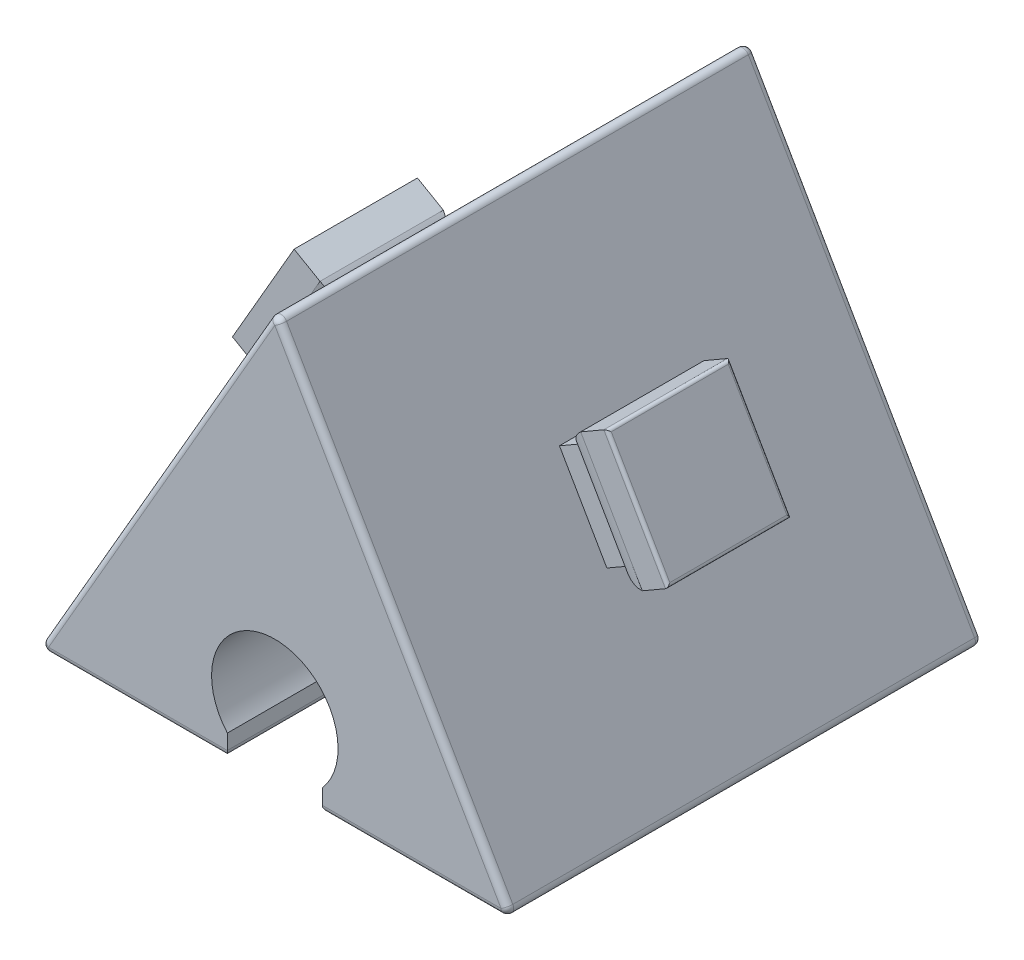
ISO-10303-21;
HEADER;
FILE_DESCRIPTION(('STEP AP214'),'2;1');
FILE_NAME('part.step','',(''),(''),'','','');
FILE_SCHEMA(('AUTOMOTIVE_DESIGN { 1 0 10303 214 1 1 1 1 }'));
ENDSEC;
DATA;
#1=APPLICATION_CONTEXT('core data for automotive mechanical design processes');
#2=APPLICATION_PROTOCOL_DEFINITION('international standard','automotive_design',2000,#1);
#3=PRODUCT_CONTEXT('',#1,'mechanical');
#4=PRODUCT('Part','Part','',(#3));
#5=PRODUCT_RELATED_PRODUCT_CATEGORY('part','',(#4));
#6=PRODUCT_DEFINITION_FORMATION('','',#4);
#7=PRODUCT_DEFINITION_CONTEXT('part definition',#1,'design');
#8=PRODUCT_DEFINITION('design','',#6,#7);
#9=PRODUCT_DEFINITION_SHAPE('','',#8);
#10=(LENGTH_UNIT() NAMED_UNIT(*) SI_UNIT(.MILLI.,.METRE.));
#11=(NAMED_UNIT(*) PLANE_ANGLE_UNIT() SI_UNIT($,.RADIAN.));
#12=(NAMED_UNIT(*) SI_UNIT($,.STERADIAN.) SOLID_ANGLE_UNIT());
#13=UNCERTAINTY_MEASURE_WITH_UNIT(LENGTH_MEASURE(1.E-05),#10,'distance_accuracy_value','');
#14=(GEOMETRIC_REPRESENTATION_CONTEXT(3) GLOBAL_UNCERTAINTY_ASSIGNED_CONTEXT((#13)) GLOBAL_UNIT_ASSIGNED_CONTEXT((#10,
#11,#12)) REPRESENTATION_CONTEXT('',''));
#15=CARTESIAN_POINT('',(0.,0.,0.));
#16=DIRECTION('',(0.,0.,1.));
#17=DIRECTION('',(1.,0.,0.));
#18=AXIS2_PLACEMENT_3D('',#15,#16,#17);
#19=CARTESIAN_POINT('',(-5.48205080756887,7.4951905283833,-2.));
#20=DIRECTION('',(0.,0.,1.));
#21=DIRECTION('',(1.,0.,0.));
#22=AXIS2_PLACEMENT_3D('',#19,#20,#21);
#23=CYLINDRICAL_SURFACE('',#22,2.00000000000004);
#24=CARTESIAN_POINT('',(-5.48205080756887,7.4951905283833,0.));
#25=DIRECTION('',(0.353553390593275,0.612372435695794,0.707106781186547));
#26=DIRECTION('',(-0.353553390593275,-0.612372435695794,0.707106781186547));
#27=AXIS2_PLACEMENT_3D('',#24,#25,#26);
#28=ELLIPSE('',#27,2.82842712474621,2.00000000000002);
#29=CARTESIAN_POINT('',(-6.07218069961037,5.58423613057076,1.95));
#30=VERTEX_POINT('',#29);
#31=CARTESIAN_POINT('',(-5.08640688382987,5.53471459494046,1.49999999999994));
#32=VERTEX_POINT('',#31);
#33=EDGE_CURVE('E60',#30,#32,#28,.T.);
#34=ORIENTED_EDGE('',*,*,#33,.F.);
#35=DIRECTION('',(0.,0.,1.));
#36=VECTOR('',#35,1.);
#37=CARTESIAN_POINT('',(-6.07218069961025,5.58423613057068,-2.));
#38=LINE('',#37,#36);
#39=CARTESIAN_POINT('',(-6.07218069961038,5.58423613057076,-1.95));
#40=VERTEX_POINT('',#39);
#41=EDGE_CURVE('E12',#40,#30,#38,.T.);
#42=ORIENTED_EDGE('',*,*,#41,.F.);
#43=CARTESIAN_POINT('',(-5.48205080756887,7.4951905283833,0.));
#44=DIRECTION('',(-0.353553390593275,-0.612372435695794,0.707106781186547));
#45=DIRECTION('',(0.353553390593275,0.612372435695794,0.707106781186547));
#46=AXIS2_PLACEMENT_3D('',#43,#44,#45);
#47=ELLIPSE('',#46,2.82842712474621,2.00000000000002);
#48=CARTESIAN_POINT('',(-5.08640688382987,5.53471459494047,-1.49999999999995));
#49=VERTEX_POINT('',#48);
#50=EDGE_CURVE('E138',#49,#40,#47,.F.);
#51=ORIENTED_EDGE('',*,*,#50,.F.);
#52=DIRECTION('',(0.,0.,1.));
#53=VECTOR('',#52,1.);
#54=CARTESIAN_POINT('',(-5.08640688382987,5.53471459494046,-2.));
#55=LINE('',#54,#53);
#56=EDGE_CURVE('E47',#49,#32,#55,.T.);
#57=ORIENTED_EDGE('',*,*,#56,.T.);
#58=EDGE_LOOP('',(#34,#42,#51,#57));
#59=FACE_BOUND('',#58,.T.);
#60=ADVANCED_FACE('F44',(#59),#23,.T.);
#61=CARTESIAN_POINT('',(-6.8900635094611,6.05644099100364,-2.));
#62=DIRECTION('',(-0.500000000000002,-0.866025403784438,0.));
#63=DIRECTION('',(0.866025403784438,-0.500000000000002,0.));
#64=AXIS2_PLACEMENT_3D('',#61,#62,#63);
#65=PLANE('',#64);
#66=DIRECTION('',(0.866025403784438,-0.500000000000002,0.));
#67=VECTOR('',#66,1.);
#68=CARTESIAN_POINT('',(-6.8900635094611,6.05644099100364,1.95));
#69=LINE('',#68,#67);
#70=CARTESIAN_POINT('',(-6.8900635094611,6.05644099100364,1.95));
#71=VERTEX_POINT('',#70);
#72=EDGE_CURVE('E103',#71,#30,#69,.T.);
#73=ORIENTED_EDGE('',*,*,#72,.F.);
#74=DIRECTION('',(0.,0.,1.));
#75=VECTOR('',#74,1.);
#76=CARTESIAN_POINT('',(-6.8900635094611,6.05644099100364,-2.));
#77=LINE('',#76,#75);
#78=CARTESIAN_POINT('',(-6.8900635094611,6.05644099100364,-1.95));
#79=VERTEX_POINT('',#78);
#80=EDGE_CURVE('E52',#79,#71,#77,.T.);
#81=ORIENTED_EDGE('',*,*,#80,.F.);
#82=DIRECTION('',(-0.866025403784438,0.500000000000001,0.));
#83=VECTOR('',#82,1.);
#84=CARTESIAN_POINT('',(-6.8900635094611,6.05644099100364,-1.95));
#85=LINE('',#84,#83);
#86=EDGE_CURVE('E149',#40,#79,#85,.T.);
#87=ORIENTED_EDGE('',*,*,#86,.F.);
#88=ORIENTED_EDGE('',*,*,#41,.T.);
#89=EDGE_LOOP('',(#73,#81,#87,#88));
#90=FACE_BOUND('',#89,.T.);
#91=ADVANCED_FACE('F114',(#90),#65,.T.);
#92=CARTESIAN_POINT('',(-5.91506350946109,7.74519052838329,-2.));
#93=DIRECTION('',(-0.866025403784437,0.500000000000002,0.));
#94=DIRECTION('',(-0.500000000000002,-0.866025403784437,0.));
#95=AXIS2_PLACEMENT_3D('',#92,#93,#94);
#96=PLANE('',#95);
#97=DIRECTION('',(-0.500000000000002,-0.866025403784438,0.));
#98=VECTOR('',#97,1.);
#99=CARTESIAN_POINT('',(-3.99496091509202,11.0709057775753,1.95));
#100=LINE('',#99,#98);
#101=CARTESIAN_POINT('',(-4.94006350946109,9.43394006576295,1.95));
#102=VERTEX_POINT('',#101);
#103=EDGE_CURVE('E99',#102,#71,#100,.T.);
#104=ORIENTED_EDGE('',*,*,#103,.F.);
#105=DIRECTION('',(0.,0.,1.));
#106=VECTOR('',#105,1.);
#107=CARTESIAN_POINT('',(-4.94006350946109,9.43394006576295,-2.));
#108=LINE('',#107,#106);
#109=CARTESIAN_POINT('',(-4.94006350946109,9.43394006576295,-1.95));
#110=VERTEX_POINT('',#109);
#111=EDGE_CURVE('E122',#110,#102,#108,.T.);
#112=ORIENTED_EDGE('',*,*,#111,.F.);
#113=DIRECTION('',(-0.500000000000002,-0.866025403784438,0.));
#114=VECTOR('',#113,1.);
#115=CARTESIAN_POINT('',(-3.99496091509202,11.0709057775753,-1.95));
#116=LINE('',#115,#114);
#117=EDGE_CURVE('E121',#110,#79,#116,.T.);
#118=ORIENTED_EDGE('',*,*,#117,.T.);
#119=ORIENTED_EDGE('',*,*,#80,.T.);
#120=EDGE_LOOP('',(#104,#112,#118,#119));
#121=FACE_BOUND('',#120,.T.);
#122=ADVANCED_FACE('F120',(#121),#96,.T.);
#123=CARTESIAN_POINT('',(-4.94006350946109,9.43394006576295,-2.));
#124=DIRECTION('',(0.500000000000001,0.866025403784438,0.));
#125=DIRECTION('',(-0.866025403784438,0.500000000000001,0.));
#126=AXIS2_PLACEMENT_3D('',#123,#124,#125);
#127=PLANE('',#126);
#128=DIRECTION('',(0.866025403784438,-0.500000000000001,0.));
#129=VECTOR('',#128,1.);
#130=CARTESIAN_POINT('',(-4.94006350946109,9.43394006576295,1.95));
#131=LINE('',#130,#129);
#132=CARTESIAN_POINT('',(-4.12218069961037,8.96173520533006,1.95));
#133=VERTEX_POINT('',#132);
#134=EDGE_CURVE('E105',#102,#133,#131,.T.);
#135=ORIENTED_EDGE('',*,*,#134,.T.);
#136=DIRECTION('',(0.,0.,1.));
#137=VECTOR('',#136,1.);
#138=CARTESIAN_POINT('',(-4.12218069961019,8.96173520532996,-2.));
#139=LINE('',#138,#137);
#140=CARTESIAN_POINT('',(-4.12218069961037,8.96173520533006,-1.95));
#141=VERTEX_POINT('',#140);
#142=EDGE_CURVE('E124',#141,#133,#139,.T.);
#143=ORIENTED_EDGE('',*,*,#142,.F.);
#144=DIRECTION('',(-0.866025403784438,0.500000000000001,0.));
#145=VECTOR('',#144,1.);
#146=CARTESIAN_POINT('',(-4.94006350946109,9.43394006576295,-1.95));
#147=LINE('',#146,#145);
#148=EDGE_CURVE('E148',#141,#110,#147,.T.);
#149=ORIENTED_EDGE('',*,*,#148,.T.);
#150=ORIENTED_EDGE('',*,*,#111,.T.);
#151=EDGE_LOOP('',(#135,#143,#149,#150));
#152=FACE_BOUND('',#151,.T.);
#153=ADVANCED_FACE('F158',(#152),#127,.T.);
#154=CARTESIAN_POINT('',(-5.48205080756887,7.4951905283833,-2.));
#155=DIRECTION('',(0.,0.,1.));
#156=DIRECTION('',(1.,0.,0.));
#157=AXIS2_PLACEMENT_3D('',#154,#155,#156);
#158=CYLINDRICAL_SURFACE('',#157,2.00000000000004);
#159=CARTESIAN_POINT('',(-5.48205080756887,7.4951905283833,0.));
#160=DIRECTION('',(-0.353553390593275,-0.612372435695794,0.707106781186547));
#161=DIRECTION('',(0.353553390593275,0.612372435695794,0.707106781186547));
#162=AXIS2_PLACEMENT_3D('',#159,#160,#161);
#163=ELLIPSE('',#162,2.82842712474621,2.00000000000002);
#164=CARTESIAN_POINT('',(-3.58640688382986,8.13279080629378,1.49999999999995));
#165=VERTEX_POINT('',#164);
#166=EDGE_CURVE('E137',#165,#133,#163,.T.);
#167=ORIENTED_EDGE('',*,*,#166,.F.);
#168=DIRECTION('',(0.,0.,1.));
#169=VECTOR('',#168,1.);
#170=CARTESIAN_POINT('',(-3.58640688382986,8.13279080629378,-2.));
#171=LINE('',#170,#169);
#172=CARTESIAN_POINT('',(-3.58640688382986,8.13279080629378,-1.49999999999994));
#173=VERTEX_POINT('',#172);
#174=EDGE_CURVE('E129',#173,#165,#171,.T.);
#175=ORIENTED_EDGE('',*,*,#174,.F.);
#176=CARTESIAN_POINT('',(-5.48205080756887,7.4951905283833,0.));
#177=DIRECTION('',(0.353553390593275,0.612372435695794,0.707106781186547));
#178=DIRECTION('',(-0.353553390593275,-0.612372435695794,0.707106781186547));
#179=AXIS2_PLACEMENT_3D('',#176,#177,#178);
#180=ELLIPSE('',#179,2.82842712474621,2.00000000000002);
#181=EDGE_CURVE('E68',#141,#173,#180,.F.);
#182=ORIENTED_EDGE('',*,*,#181,.F.);
#183=ORIENTED_EDGE('',*,*,#142,.T.);
#184=EDGE_LOOP('',(#167,#175,#182,#183));
#185=FACE_BOUND('',#184,.T.);
#186=ADVANCED_FACE('F161',(#185),#158,.T.);
#187=CARTESIAN_POINT('',(-3.58640688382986,8.13279080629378,-2.));
#188=DIRECTION('',(0.866025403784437,-0.500000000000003,0.));
#189=DIRECTION('',(0.500000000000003,0.866025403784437,0.));
#190=AXIS2_PLACEMENT_3D('',#187,#188,#189);
#191=PLANE('',#190);
#192=DIRECTION('',(-0.500000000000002,-0.866025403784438,0.));
#193=VECTOR('',#192,1.);
#194=CARTESIAN_POINT('',(-2.4163042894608,10.1594679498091,1.49999999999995));
#195=LINE('',#194,#193);
#196=EDGE_CURVE('E110',#165,#32,#195,.T.);
#197=ORIENTED_EDGE('',*,*,#196,.T.);
#198=ORIENTED_EDGE('',*,*,#56,.F.);
#199=DIRECTION('',(-0.500000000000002,-0.866025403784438,0.));
#200=VECTOR('',#199,1.);
#201=CARTESIAN_POINT('',(-2.4163042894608,10.1594679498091,-1.49999999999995));
#202=LINE('',#201,#200);
#203=EDGE_CURVE('E117',#173,#49,#202,.T.);
#204=ORIENTED_EDGE('',*,*,#203,.F.);
#205=ORIENTED_EDGE('',*,*,#174,.T.);
#206=EDGE_LOOP('',(#197,#198,#204,#205));
#207=FACE_BOUND('',#206,.T.);
#208=ADVANCED_FACE('F163',(#207),#191,.T.);
#209=CARTESIAN_POINT('',(-3.5619482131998,10.8209057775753,0.));
#210=DIRECTION('',(-0.500000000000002,-0.866025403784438,0.));
#211=DIRECTION('',(0.866025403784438,-0.500000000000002,0.));
#212=AXIS2_PLACEMENT_3D('',#209,#210,#211);
#213=CYLINDRICAL_SURFACE('',#212,2.);
#214=ORIENTED_EDGE('',*,*,#50,.T.);
#215=DIRECTION('',(-0.500000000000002,-0.866025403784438,0.));
#216=VECTOR('',#215,1.);
#217=CARTESIAN_POINT('',(-3.1770781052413,10.5987009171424,-1.95));
#218=LINE('',#217,#216);
#219=EDGE_CURVE('E145',#141,#40,#218,.T.);
#220=ORIENTED_EDGE('',*,*,#219,.F.);
#221=ORIENTED_EDGE('',*,*,#181,.T.);
#222=ORIENTED_EDGE('',*,*,#203,.T.);
#223=EDGE_LOOP('',(#214,#220,#221,#222));
#224=FACE_BOUND('',#223,.T.);
#225=ADVANCED_FACE('F164',(#224),#213,.T.);
#226=CARTESIAN_POINT('',(-3.99496091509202,11.0709057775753,-1.95));
#227=DIRECTION('',(0.,0.,1.));
#228=DIRECTION('',(1.,0.,0.));
#229=AXIS2_PLACEMENT_3D('',#226,#227,#228);
#230=PLANE('',#229);
#231=ORIENTED_EDGE('',*,*,#219,.T.);
#232=ORIENTED_EDGE('',*,*,#86,.T.);
#233=ORIENTED_EDGE('',*,*,#117,.F.);
#234=ORIENTED_EDGE('',*,*,#148,.F.);
#235=EDGE_LOOP('',(#231,#232,#233,#234));
#236=FACE_BOUND('',#235,.T.);
#237=ADVANCED_FACE('F184',(#236),#230,.F.);
#238=CARTESIAN_POINT('',(-3.5619482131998,10.8209057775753,0.));
#239=DIRECTION('',(-0.500000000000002,-0.866025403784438,0.));
#240=DIRECTION('',(0.866025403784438,-0.500000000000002,0.));
#241=AXIS2_PLACEMENT_3D('',#238,#239,#240);
#242=CYLINDRICAL_SURFACE('',#241,2.);
#243=ORIENTED_EDGE('',*,*,#33,.T.);
#244=ORIENTED_EDGE('',*,*,#196,.F.);
#245=ORIENTED_EDGE('',*,*,#166,.T.);
#246=DIRECTION('',(-0.500000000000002,-0.866025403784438,0.));
#247=VECTOR('',#246,1.);
#248=CARTESIAN_POINT('',(-3.1770781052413,10.5987009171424,1.95));
#249=LINE('',#248,#247);
#250=EDGE_CURVE('E143',#133,#30,#249,.T.);
#251=ORIENTED_EDGE('',*,*,#250,.T.);
#252=EDGE_LOOP('',(#243,#244,#245,#251));
#253=FACE_BOUND('',#252,.T.);
#254=ADVANCED_FACE('F162',(#253),#242,.T.);
#255=CARTESIAN_POINT('',(-3.99496091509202,11.0709057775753,1.95));
#256=DIRECTION('',(0.,0.,-1.));
#257=DIRECTION('',(-1.,0.,0.));
#258=AXIS2_PLACEMENT_3D('',#255,#256,#257);
#259=PLANE('',#258);
#260=ORIENTED_EDGE('',*,*,#103,.T.);
#261=ORIENTED_EDGE('',*,*,#72,.T.);
#262=ORIENTED_EDGE('',*,*,#250,.F.);
#263=ORIENTED_EDGE('',*,*,#134,.F.);
#264=EDGE_LOOP('',(#260,#261,#262,#263));
#265=FACE_BOUND('',#264,.T.);
#266=ADVANCED_FACE('F101',(#265),#259,.F.);
#267=CLOSED_SHELL('',(#60,#91,#122,#153,#186,#208,#225,#237,#254,#266));
#268=MANIFOLD_SOLID_BREP('B2',#267);
#269=CARTESIAN_POINT('',(-7.5,0.,-7.5));
#270=DIRECTION('',(0.,-1.,0.));
#271=DIRECTION('',(0.,0.,-1.));
#272=AXIS2_PLACEMENT_3D('',#269,#270,#271);
#273=PLANE('',#272);
#274=DIRECTION('',(0.,0.,1.));
#275=VECTOR('',#274,1.);
#276=CARTESIAN_POINT('',(7.15358983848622,0.,-7.5));
#277=LINE('',#276,#275);
#278=CARTESIAN_POINT('',(7.15358983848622,0.,-7.3));
#279=VERTEX_POINT('',#278);
#280=CARTESIAN_POINT('',(7.15358983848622,0.,7.3));
#281=VERTEX_POINT('',#280);
#282=EDGE_CURVE('E606',#279,#281,#277,.T.);
#283=ORIENTED_EDGE('',*,*,#282,.T.);
#284=DIRECTION('',(1.,0.,0.));
#285=VECTOR('',#284,1.);
#286=CARTESIAN_POINT('',(-7.5,0.,7.3));
#287=LINE('',#286,#285);
#288=CARTESIAN_POINT('',(1.7,0.,7.3));
#289=VERTEX_POINT('',#288);
#290=EDGE_CURVE('E608',#281,#289,#287,.F.);
#291=ORIENTED_EDGE('',*,*,#290,.T.);
#292=DIRECTION('',(0.,0.,1.));
#293=VECTOR('',#292,1.);
#294=CARTESIAN_POINT('',(1.7,0.,-7.5));
#295=LINE('',#294,#293);
#296=CARTESIAN_POINT('',(1.7,0.,-7.3));
#297=VERTEX_POINT('',#296);
#298=EDGE_CURVE('E602',#289,#297,#295,.F.);
#299=ORIENTED_EDGE('',*,*,#298,.T.);
#300=DIRECTION('',(1.,0.,0.));
#301=VECTOR('',#300,1.);
#302=CARTESIAN_POINT('',(7.5,0.,-7.3));
#303=LINE('',#302,#301);
#304=EDGE_CURVE('E604',#297,#279,#303,.T.);
#305=ORIENTED_EDGE('',*,*,#304,.T.);
#306=EDGE_LOOP('',(#283,#291,#299,#305));
#307=FACE_BOUND('',#306,.T.);
#308=ADVANCED_FACE('F250',(#307),#273,.T.);
#309=DIRECTION('',(0.,0.,1.));
#310=VECTOR('',#309,1.);
#311=CARTESIAN_POINT('',(-7.15358983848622,0.,-7.5));
#312=LINE('',#311,#310);
#313=CARTESIAN_POINT('',(-7.15358983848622,0.,7.3));
#314=VERTEX_POINT('',#313);
#315=CARTESIAN_POINT('',(-7.15358983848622,0.,-7.3));
#316=VERTEX_POINT('',#315);
#317=EDGE_CURVE('E634',#314,#316,#312,.F.);
#318=ORIENTED_EDGE('',*,*,#317,.T.);
#319=DIRECTION('',(1.,0.,0.));
#320=VECTOR('',#319,1.);
#321=CARTESIAN_POINT('',(-1.5,0.,-7.3));
#322=LINE('',#321,#320);
#323=CARTESIAN_POINT('',(-1.7,0.,-7.3));
#324=VERTEX_POINT('',#323);
#325=EDGE_CURVE('E636',#316,#324,#322,.T.);
#326=ORIENTED_EDGE('',*,*,#325,.T.);
#327=DIRECTION('',(0.,0.,1.));
#328=VECTOR('',#327,1.);
#329=CARTESIAN_POINT('',(-1.7,0.,7.5));
#330=LINE('',#329,#328);
#331=CARTESIAN_POINT('',(-1.7,0.,7.3));
#332=VERTEX_POINT('',#331);
#333=EDGE_CURVE('E630',#324,#332,#330,.T.);
#334=ORIENTED_EDGE('',*,*,#333,.T.);
#335=DIRECTION('',(1.,0.,0.));
#336=VECTOR('',#335,1.);
#337=CARTESIAN_POINT('',(-7.5,0.,7.3));
#338=LINE('',#337,#336);
#339=EDGE_CURVE('E632',#332,#314,#338,.F.);
#340=ORIENTED_EDGE('',*,*,#339,.T.);
#341=EDGE_LOOP('',(#318,#326,#334,#340));
#342=FACE_BOUND('',#341,.T.);
#343=ADVANCED_FACE('F715',(#342),#273,.T.);
#344=CARTESIAN_POINT('',(-7.5,0.,-7.5));
#345=DIRECTION('',(-0.86602540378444,0.499999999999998,0.));
#346=DIRECTION('',(-0.499999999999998,-0.86602540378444,0.));
#347=AXIS2_PLACEMENT_3D('',#344,#345,#346);
#348=PLANE('',#347);
#349=DIRECTION('',(-0.500000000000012,-0.866025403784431,0.));
#350=VECTOR('',#349,1.);
#351=CARTESIAN_POINT('',(-4.5,5.19615242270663,-1.5));
#352=LINE('',#351,#350);
#353=CARTESIAN_POINT('',(-2.99999999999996,7.79422863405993,-1.5));
#354=VERTEX_POINT('',#353);
#355=CARTESIAN_POINT('',(-4.5,5.19615242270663,-1.5));
#356=VERTEX_POINT('',#355);
#357=EDGE_CURVE('E455',#354,#356,#352,.T.);
#358=ORIENTED_EDGE('',*,*,#357,.F.);
#359=DIRECTION('',(0.,0.,1.));
#360=VECTOR('',#359,1.);
#361=CARTESIAN_POINT('',(-2.99999999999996,7.79422863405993,-1.5));
#362=LINE('',#361,#360);
#363=CARTESIAN_POINT('',(-2.99999999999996,7.79422863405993,1.5));
#364=VERTEX_POINT('',#363);
#365=EDGE_CURVE('E475',#354,#364,#362,.T.);
#366=ORIENTED_EDGE('',*,*,#365,.T.);
#367=DIRECTION('',(-0.500000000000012,-0.866025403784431,0.));
#368=VECTOR('',#367,1.);
#369=CARTESIAN_POINT('',(-4.5,5.19615242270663,1.5));
#370=LINE('',#369,#368);
#371=CARTESIAN_POINT('',(-4.50000000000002,5.19615242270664,1.5));
#372=VERTEX_POINT('',#371);
#373=EDGE_CURVE('E460',#364,#372,#370,.T.);
#374=ORIENTED_EDGE('',*,*,#373,.T.);
#375=DIRECTION('',(0.,0.,1.));
#376=VECTOR('',#375,1.);
#377=CARTESIAN_POINT('',(-4.5,5.19615242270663,-1.5));
#378=LINE('',#377,#376);
#379=EDGE_CURVE('E478',#356,#372,#378,.T.);
#380=ORIENTED_EDGE('',*,*,#379,.F.);
#381=EDGE_LOOP('',(#358,#366,#374,#380));
#382=FACE_BOUND('',#381,.T.);
#383=DIRECTION('',(-0.499999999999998,-0.86602540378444,0.));
#384=VECTOR('',#383,1.);
#385=CARTESIAN_POINT('',(-7.5,0.,-7.3));
#386=LINE('',#385,#384);
#387=CARTESIAN_POINT('',(-0.173205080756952,12.6903810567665,-7.3));
#388=VERTEX_POINT('',#387);
#389=CARTESIAN_POINT('',(-7.32679491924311,0.3,-7.3));
#390=VERTEX_POINT('',#389);
#391=EDGE_CURVE('E275',#388,#390,#386,.T.);
#392=ORIENTED_EDGE('',*,*,#391,.T.);
#393=DIRECTION('',(0.,0.,1.));
#394=VECTOR('',#393,1.);
#395=CARTESIAN_POINT('',(-7.32679491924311,0.3,-7.5));
#396=LINE('',#395,#394);
#397=CARTESIAN_POINT('',(-7.32679491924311,0.3,7.3));
#398=VERTEX_POINT('',#397);
#399=EDGE_CURVE('E259',#390,#398,#396,.T.);
#400=ORIENTED_EDGE('',*,*,#399,.T.);
#401=DIRECTION('',(-0.499999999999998,-0.86602540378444,0.));
#402=VECTOR('',#401,1.);
#403=CARTESIAN_POINT('',(-7.5,0.,7.3));
#404=LINE('',#403,#402);
#405=CARTESIAN_POINT('',(-0.173205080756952,12.6903810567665,7.3));
#406=VERTEX_POINT('',#405);
#407=EDGE_CURVE('E641',#398,#406,#404,.F.);
#408=ORIENTED_EDGE('',*,*,#407,.T.);
#409=DIRECTION('',(0.,0.,1.));
#410=VECTOR('',#409,1.);
#411=CARTESIAN_POINT('',(-0.173205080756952,12.6903810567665,-7.5));
#412=LINE('',#411,#410);
#413=EDGE_CURVE('E639',#406,#388,#412,.F.);
#414=ORIENTED_EDGE('',*,*,#413,.T.);
#415=EDGE_LOOP('',(#392,#400,#408,#414));
#416=FACE_BOUND('',#415,.T.);
#417=ADVANCED_FACE('F734',(#382,#416),#348,.T.);
#418=CARTESIAN_POINT('',(7.5,0.,-7.5));
#419=DIRECTION('',(0.866025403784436,0.500000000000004,0.));
#420=DIRECTION('',(-0.500000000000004,0.866025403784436,0.));
#421=AXIS2_PLACEMENT_3D('',#418,#419,#420);
#422=PLANE('',#421);
#423=DIRECTION('',(-0.500000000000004,0.866025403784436,0.));
#424=VECTOR('',#423,1.);
#425=CARTESIAN_POINT('',(7.5,0.,7.3));
#426=LINE('',#425,#424);
#427=CARTESIAN_POINT('',(0.173205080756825,12.6903810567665,7.3));
#428=VERTEX_POINT('',#427);
#429=CARTESIAN_POINT('',(7.32679491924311,0.3,7.3));
#430=VERTEX_POINT('',#429);
#431=EDGE_CURVE('E611',#428,#430,#426,.F.);
#432=ORIENTED_EDGE('',*,*,#431,.T.);
#433=DIRECTION('',(0.,0.,1.));
#434=VECTOR('',#433,1.);
#435=CARTESIAN_POINT('',(7.32679491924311,0.3,-7.5));
#436=LINE('',#435,#434);
#437=CARTESIAN_POINT('',(7.32679491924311,0.3,-7.3));
#438=VERTEX_POINT('',#437);
#439=EDGE_CURVE('E617',#430,#438,#436,.F.);
#440=ORIENTED_EDGE('',*,*,#439,.T.);
#441=DIRECTION('',(-0.500000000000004,0.866025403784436,0.));
#442=VECTOR('',#441,1.);
#443=CARTESIAN_POINT('',(0.,12.9903810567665,-7.3));
#444=LINE('',#443,#442);
#445=CARTESIAN_POINT('',(0.173205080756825,12.6903810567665,-7.3));
#446=VERTEX_POINT('',#445);
#447=EDGE_CURVE('E615',#438,#446,#444,.T.);
#448=ORIENTED_EDGE('',*,*,#447,.T.);
#449=DIRECTION('',(0.,0.,1.));
#450=VECTOR('',#449,1.);
#451=CARTESIAN_POINT('',(0.173205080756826,12.6903810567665,-7.5));
#452=LINE('',#451,#450);
#453=EDGE_CURVE('E613',#446,#428,#452,.T.);
#454=ORIENTED_EDGE('',*,*,#453,.T.);
#455=EDGE_LOOP('',(#432,#440,#448,#454));
#456=FACE_BOUND('',#455,.T.);
#457=DIRECTION('',(0.500000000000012,-0.866025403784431,0.));
#458=VECTOR('',#457,1.);
#459=CARTESIAN_POINT('',(4.5,5.19615242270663,-1.5));
#460=LINE('',#459,#458);
#461=CARTESIAN_POINT('',(2.99999999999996,7.79422863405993,-1.5));
#462=VERTEX_POINT('',#461);
#463=CARTESIAN_POINT('',(4.5,5.19615242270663,-1.5));
#464=VERTEX_POINT('',#463);
#465=EDGE_CURVE('E522',#462,#464,#460,.T.);
#466=ORIENTED_EDGE('',*,*,#465,.T.);
#467=DIRECTION('',(0.,0.,1.));
#468=VECTOR('',#467,1.);
#469=CARTESIAN_POINT('',(4.5,5.19615242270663,-1.5));
#470=LINE('',#469,#468);
#471=CARTESIAN_POINT('',(4.5,5.19615242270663,1.5));
#472=VERTEX_POINT('',#471);
#473=EDGE_CURVE('E538',#464,#472,#470,.T.);
#474=ORIENTED_EDGE('',*,*,#473,.T.);
#475=DIRECTION('',(0.500000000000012,-0.866025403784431,0.));
#476=VECTOR('',#475,1.);
#477=CARTESIAN_POINT('',(4.5,5.19615242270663,1.5));
#478=LINE('',#477,#476);
#479=CARTESIAN_POINT('',(2.99999999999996,7.79422863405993,1.5));
#480=VERTEX_POINT('',#479);
#481=EDGE_CURVE('E511',#480,#472,#478,.T.);
#482=ORIENTED_EDGE('',*,*,#481,.F.);
#483=DIRECTION('',(0.,0.,1.));
#484=VECTOR('',#483,1.);
#485=CARTESIAN_POINT('',(2.99999999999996,7.79422863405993,-1.5));
#486=LINE('',#485,#484);
#487=EDGE_CURVE('E530',#462,#480,#486,.T.);
#488=ORIENTED_EDGE('',*,*,#487,.F.);
#489=EDGE_LOOP('',(#466,#474,#482,#488));
#490=FACE_BOUND('',#489,.T.);
#491=ADVANCED_FACE('F765',(#456,#490),#422,.T.);
#492=CARTESIAN_POINT('',(7.5,0.,-7.5));
#493=DIRECTION('',(0.,0.,1.));
#494=DIRECTION('',(1.,0.,0.));
#495=AXIS2_PLACEMENT_3D('',#492,#493,#494);
#496=PLANE('',#495);
#497=DIRECTION('',(-0.500000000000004,0.866025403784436,0.));
#498=VECTOR('',#497,1.);
#499=CARTESIAN_POINT('',(7.32679491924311,-0.100000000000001,-7.5));
#500=LINE('',#499,#498);
#501=CARTESIAN_POINT('',(0.,12.5903810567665,-7.5));
#502=VERTEX_POINT('',#501);
#503=CARTESIAN_POINT('',(7.15358983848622,0.2,-7.5));
#504=VERTEX_POINT('',#503);
#505=EDGE_CURVE('E620',#502,#504,#500,.F.);
#506=ORIENTED_EDGE('',*,*,#505,.T.);
#507=DIRECTION('',(1.,0.,0.));
#508=VECTOR('',#507,1.);
#509=CARTESIAN_POINT('',(1.5,0.2,-7.5));
#510=LINE('',#509,#508);
#511=CARTESIAN_POINT('',(1.5,0.2,-7.5));
#512=VERTEX_POINT('',#511);
#513=EDGE_CURVE('E626',#504,#512,#510,.F.);
#514=ORIENTED_EDGE('',*,*,#513,.T.);
#515=DIRECTION('',(0.,-1.,0.));
#516=VECTOR('',#515,1.);
#517=CARTESIAN_POINT('',(1.5,0.677124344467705,-7.5));
#518=LINE('',#517,#516);
#519=CARTESIAN_POINT('',(1.5,0.677124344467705,-7.5));
#520=VERTEX_POINT('',#519);
#521=EDGE_CURVE('E545',#520,#512,#518,.T.);
#522=ORIENTED_EDGE('',*,*,#521,.F.);
#523=CARTESIAN_POINT('',(0.,2.,-7.5));
#524=DIRECTION('',(0.,0.,1.));
#525=DIRECTION('',(1.,0.,0.));
#526=AXIS2_PLACEMENT_3D('',#523,#524,#525);
#527=CIRCLE('',#526,2.);
#528=CARTESIAN_POINT('',(-1.5,0.677124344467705,-7.5));
#529=VERTEX_POINT('',#528);
#530=EDGE_CURVE('E534',#529,#520,#527,.F.);
#531=ORIENTED_EDGE('',*,*,#530,.F.);
#532=DIRECTION('',(0.,1.,0.));
#533=VECTOR('',#532,1.);
#534=CARTESIAN_POINT('',(-1.5,0.677124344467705,-7.5));
#535=LINE('',#534,#533);
#536=CARTESIAN_POINT('',(-1.5,0.2,-7.5));
#537=VERTEX_POINT('',#536);
#538=EDGE_CURVE('E559',#537,#529,#535,.T.);
#539=ORIENTED_EDGE('',*,*,#538,.F.);
#540=DIRECTION('',(1.,0.,0.));
#541=VECTOR('',#540,1.);
#542=CARTESIAN_POINT('',(-7.5,0.2,-7.5));
#543=LINE('',#542,#541);
#544=CARTESIAN_POINT('',(-7.15358983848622,0.2,-7.5));
#545=VERTEX_POINT('',#544);
#546=EDGE_CURVE('E624',#537,#545,#543,.F.);
#547=ORIENTED_EDGE('',*,*,#546,.T.);
#548=DIRECTION('',(-0.499999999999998,-0.86602540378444,0.));
#549=VECTOR('',#548,1.);
#550=CARTESIAN_POINT('',(0.173205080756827,12.8903810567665,-7.5));
#551=LINE('',#550,#549);
#552=EDGE_CURVE('E622',#545,#502,#551,.F.);
#553=ORIENTED_EDGE('',*,*,#552,.T.);
#554=EDGE_LOOP('',(#506,#514,#522,#531,#539,#547,#553));
#555=FACE_BOUND('',#554,.T.);
#556=ADVANCED_FACE('F1165',(#555),#496,.F.);
#557=CARTESIAN_POINT('',(7.5,0.,7.5));
#558=DIRECTION('',(0.,0.,1.));
#559=DIRECTION('',(1.,0.,0.));
#560=AXIS2_PLACEMENT_3D('',#557,#558,#559);
#561=PLANE('',#560);
#562=DIRECTION('',(0.,1.,0.));
#563=VECTOR('',#562,1.);
#564=CARTESIAN_POINT('',(1.5,0.677124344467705,7.5));
#565=LINE('',#564,#563);
#566=CARTESIAN_POINT('',(1.5,0.2,7.5));
#567=VERTEX_POINT('',#566);
#568=CARTESIAN_POINT('',(1.5,0.677124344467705,7.5));
#569=VERTEX_POINT('',#568);
#570=EDGE_CURVE('E553',#567,#569,#565,.T.);
#571=ORIENTED_EDGE('',*,*,#570,.F.);
#572=DIRECTION('',(1.,0.,0.));
#573=VECTOR('',#572,1.);
#574=CARTESIAN_POINT('',(7.5,0.2,7.5));
#575=LINE('',#574,#573);
#576=CARTESIAN_POINT('',(7.15358983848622,0.2,7.5));
#577=VERTEX_POINT('',#576);
#578=EDGE_CURVE('E599',#567,#577,#575,.T.);
#579=ORIENTED_EDGE('',*,*,#578,.T.);
#580=DIRECTION('',(-0.500000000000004,0.866025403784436,0.));
#581=VECTOR('',#580,1.);
#582=CARTESIAN_POINT('',(7.32679491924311,-0.0999999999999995,7.5));
#583=LINE('',#582,#581);
#584=CARTESIAN_POINT('',(0.,12.5903810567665,7.5));
#585=VERTEX_POINT('',#584);
#586=EDGE_CURVE('E584',#577,#585,#583,.T.);
#587=ORIENTED_EDGE('',*,*,#586,.T.);
#588=DIRECTION('',(-0.499999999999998,-0.86602540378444,0.));
#589=VECTOR('',#588,1.);
#590=CARTESIAN_POINT('',(-3.57679491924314,6.39519052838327,7.5));
#591=LINE('',#590,#589);
#592=CARTESIAN_POINT('',(-7.15358983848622,0.2,7.5));
#593=VERTEX_POINT('',#592);
#594=EDGE_CURVE('E595',#585,#593,#591,.T.);
#595=ORIENTED_EDGE('',*,*,#594,.T.);
#596=DIRECTION('',(1.,0.,0.));
#597=VECTOR('',#596,1.);
#598=CARTESIAN_POINT('',(7.5,0.2,7.5));
#599=LINE('',#598,#597);
#600=CARTESIAN_POINT('',(-1.5,0.2,7.5));
#601=VERTEX_POINT('',#600);
#602=EDGE_CURVE('E597',#593,#601,#599,.T.);
#603=ORIENTED_EDGE('',*,*,#602,.T.);
#604=DIRECTION('',(0.,-1.,0.));
#605=VECTOR('',#604,1.);
#606=CARTESIAN_POINT('',(-1.5,0.677124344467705,7.5));
#607=LINE('',#606,#605);
#608=CARTESIAN_POINT('',(-1.5,0.677124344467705,7.5));
#609=VERTEX_POINT('',#608);
#610=EDGE_CURVE('E550',#609,#601,#607,.T.);
#611=ORIENTED_EDGE('',*,*,#610,.F.);
#612=CARTESIAN_POINT('',(0.,2.,7.5));
#613=DIRECTION('',(0.,0.,1.));
#614=DIRECTION('',(1.,0.,0.));
#615=AXIS2_PLACEMENT_3D('',#612,#613,#614);
#616=CIRCLE('',#615,2.);
#617=EDGE_CURVE('E548',#569,#609,#616,.T.);
#618=ORIENTED_EDGE('',*,*,#617,.F.);
#619=EDGE_LOOP('',(#571,#579,#587,#595,#603,#611,#618));
#620=FACE_BOUND('',#619,.T.);
#621=ADVANCED_FACE('F1152',(#620),#561,.T.);
#622=CARTESIAN_POINT('',(0.,2.,-7.501));
#623=DIRECTION('',(0.,0.,1.));
#624=DIRECTION('',(1.,0.,0.));
#625=AXIS2_PLACEMENT_3D('',#622,#623,#624);
#626=CYLINDRICAL_SURFACE('',#625,2.);
#627=ORIENTED_EDGE('',*,*,#530,.T.);
#628=DIRECTION('',(0.,0.,1.));
#629=VECTOR('',#628,1.);
#630=CARTESIAN_POINT('',(1.5,0.677124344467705,-7.501));
#631=LINE('',#630,#629);
#632=EDGE_CURVE('E556',#520,#569,#631,.T.);
#633=ORIENTED_EDGE('',*,*,#632,.T.);
#634=ORIENTED_EDGE('',*,*,#617,.T.);
#635=DIRECTION('',(0.,0.,1.));
#636=VECTOR('',#635,1.);
#637=CARTESIAN_POINT('',(-1.5,0.677124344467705,-7.501));
#638=LINE('',#637,#636);
#639=EDGE_CURVE('E555',#529,#609,#638,.T.);
#640=ORIENTED_EDGE('',*,*,#639,.F.);
#641=EDGE_LOOP('',(#627,#633,#634,#640));
#642=FACE_BOUND('',#641,.T.);
#643=ADVANCED_FACE('F1143',(#642),#626,.F.);
#644=CARTESIAN_POINT('',(1.5,0.677124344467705,-7.501));
#645=DIRECTION('',(1.,0.,0.));
#646=DIRECTION('',(0.,0.,-1.));
#647=AXIS2_PLACEMENT_3D('',#644,#645,#646);
#648=PLANE('',#647);
#649=ORIENTED_EDGE('',*,*,#521,.T.);
#650=DIRECTION('',(0.,0.,1.));
#651=VECTOR('',#650,1.);
#652=CARTESIAN_POINT('',(1.5,0.2,7.5));
#653=LINE('',#652,#651);
#654=EDGE_CURVE('E628',#512,#567,#653,.T.);
#655=ORIENTED_EDGE('',*,*,#654,.T.);
#656=ORIENTED_EDGE('',*,*,#570,.T.);
#657=ORIENTED_EDGE('',*,*,#632,.F.);
#658=EDGE_LOOP('',(#649,#655,#656,#657));
#659=FACE_BOUND('',#658,.T.);
#660=ADVANCED_FACE('F1134',(#659),#648,.F.);
#661=CARTESIAN_POINT('',(-1.5,0.677124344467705,-7.501));
#662=DIRECTION('',(-1.,0.,0.));
#663=DIRECTION('',(0.,0.,1.));
#664=AXIS2_PLACEMENT_3D('',#661,#662,#663);
#665=PLANE('',#664);
#666=ORIENTED_EDGE('',*,*,#610,.T.);
#667=DIRECTION('',(0.,0.,1.));
#668=VECTOR('',#667,1.);
#669=CARTESIAN_POINT('',(-1.5,0.2,-7.5));
#670=LINE('',#669,#668);
#671=EDGE_CURVE('E42',#601,#537,#670,.F.);
#672=ORIENTED_EDGE('',*,*,#671,.T.);
#673=ORIENTED_EDGE('',*,*,#538,.T.);
#674=ORIENTED_EDGE('',*,*,#639,.T.);
#675=EDGE_LOOP('',(#666,#672,#673,#674));
#676=FACE_BOUND('',#675,.T.);
#677=ADVANCED_FACE('F1083',(#676),#665,.F.);
#678=CARTESIAN_POINT('',(2.99999999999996,7.79422863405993,-1.5));
#679=DIRECTION('',(-0.500000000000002,0.866025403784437,0.));
#680=DIRECTION('',(-0.866025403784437,-0.500000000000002,0.));
#681=AXIS2_PLACEMENT_3D('',#678,#679,#680);
#682=PLANE('',#681);
#683=ORIENTED_EDGE('',*,*,#487,.T.);
#684=DIRECTION('',(-0.866025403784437,-0.500000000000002,0.));
#685=VECTOR('',#684,1.);
#686=CARTESIAN_POINT('',(2.99999999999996,7.79422863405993,1.5));
#687=LINE('',#686,#685);
#688=CARTESIAN_POINT('',(3.58640688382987,8.13279080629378,1.49999999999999));
#689=VERTEX_POINT('',#688);
#690=EDGE_CURVE('E508',#689,#480,#687,.T.);
#691=ORIENTED_EDGE('',*,*,#690,.F.);
#692=DIRECTION('',(0.,0.,1.));
#693=VECTOR('',#692,1.);
#694=CARTESIAN_POINT('',(3.58640688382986,8.13279080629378,-1.5));
#695=LINE('',#694,#693);
#696=CARTESIAN_POINT('',(3.58640688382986,8.13279080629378,-1.5));
#697=VERTEX_POINT('',#696);
#698=EDGE_CURVE('E531',#697,#689,#695,.T.);
#699=ORIENTED_EDGE('',*,*,#698,.F.);
#700=DIRECTION('',(-0.866025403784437,-0.500000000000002,0.));
#701=VECTOR('',#700,1.);
#702=CARTESIAN_POINT('',(2.99999999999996,7.79422863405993,-1.5));
#703=LINE('',#702,#701);
#704=EDGE_CURVE('E519',#697,#462,#703,.T.);
#705=ORIENTED_EDGE('',*,*,#704,.T.);
#706=EDGE_LOOP('',(#683,#691,#699,#705));
#707=FACE_BOUND('',#706,.T.);
#708=ADVANCED_FACE('F1074',(#707),#682,.T.);
#709=CARTESIAN_POINT('',(5.08640688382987,5.53471459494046,-1.5));
#710=DIRECTION('',(0.500000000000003,-0.866025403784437,0.));
#711=DIRECTION('',(0.866025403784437,0.500000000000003,0.));
#712=AXIS2_PLACEMENT_3D('',#709,#710,#711);
#713=PLANE('',#712);
#714=DIRECTION('',(0.,0.,1.));
#715=VECTOR('',#714,1.);
#716=CARTESIAN_POINT('',(5.08640688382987,5.53471459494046,-1.5));
#717=LINE('',#716,#715);
#718=CARTESIAN_POINT('',(5.08640688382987,5.53471459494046,-1.5));
#719=VERTEX_POINT('',#718);
#720=CARTESIAN_POINT('',(5.08640688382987,5.53471459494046,1.5));
#721=VERTEX_POINT('',#720);
#722=EDGE_CURVE('E535',#719,#721,#717,.T.);
#723=ORIENTED_EDGE('',*,*,#722,.T.);
#724=DIRECTION('',(0.866025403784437,0.500000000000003,0.));
#725=VECTOR('',#724,1.);
#726=CARTESIAN_POINT('',(5.08640688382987,5.53471459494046,1.5));
#727=LINE('',#726,#725);
#728=EDGE_CURVE('E513',#472,#721,#727,.T.);
#729=ORIENTED_EDGE('',*,*,#728,.F.);
#730=ORIENTED_EDGE('',*,*,#473,.F.);
#731=DIRECTION('',(0.866025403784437,0.500000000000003,0.));
#732=VECTOR('',#731,1.);
#733=CARTESIAN_POINT('',(5.08640688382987,5.53471459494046,-1.5));
#734=LINE('',#733,#732);
#735=EDGE_CURVE('E525',#464,#719,#734,.T.);
#736=ORIENTED_EDGE('',*,*,#735,.T.);
#737=EDGE_LOOP('',(#723,#729,#730,#736));
#738=FACE_BOUND('',#737,.T.);
#739=ADVANCED_FACE('F1065',(#738),#713,.T.);
#740=CARTESIAN_POINT('',(3.58640688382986,8.13279080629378,-1.5));
#741=DIRECTION('',(0.,0.,-1.));
#742=DIRECTION('',(-1.,0.,0.));
#743=AXIS2_PLACEMENT_3D('',#740,#741,#742);
#744=PLANE('',#743);
#745=ORIENTED_EDGE('',*,*,#704,.F.);
#746=DIRECTION('',(-0.500000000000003,0.866025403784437,0.));
#747=VECTOR('',#746,1.);
#748=CARTESIAN_POINT('',(3.58640688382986,8.13279080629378,-1.5));
#749=LINE('',#748,#747);
#750=EDGE_CURVE('E528',#719,#697,#749,.T.);
#751=ORIENTED_EDGE('',*,*,#750,.F.);
#752=ORIENTED_EDGE('',*,*,#735,.F.);
#753=ORIENTED_EDGE('',*,*,#465,.F.);
#754=EDGE_LOOP('',(#745,#751,#752,#753));
#755=FACE_BOUND('',#754,.T.);
#756=ADVANCED_FACE('F1055',(#755),#744,.T.);
#757=CARTESIAN_POINT('',(3.58640688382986,8.13279080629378,1.5));
#758=DIRECTION('',(0.,0.,-1.));
#759=DIRECTION('',(-1.,0.,0.));
#760=AXIS2_PLACEMENT_3D('',#757,#758,#759);
#761=PLANE('',#760);
#762=ORIENTED_EDGE('',*,*,#690,.T.);
#763=ORIENTED_EDGE('',*,*,#481,.T.);
#764=ORIENTED_EDGE('',*,*,#728,.T.);
#765=DIRECTION('',(-0.500000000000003,0.866025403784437,0.));
#766=VECTOR('',#765,1.);
#767=CARTESIAN_POINT('',(3.58640688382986,8.13279080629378,1.5));
#768=LINE('',#767,#766);
#769=EDGE_CURVE('E516',#721,#689,#768,.T.);
#770=ORIENTED_EDGE('',*,*,#769,.T.);
#771=EDGE_LOOP('',(#762,#763,#764,#770));
#772=FACE_BOUND('',#771,.T.);
#773=ADVANCED_FACE('F1048',(#772),#761,.F.);
#774=CARTESIAN_POINT('',(5.48205080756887,7.4951905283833,-2.));
#775=DIRECTION('',(0.,0.,1.));
#776=DIRECTION('',(1.,0.,0.));
#777=AXIS2_PLACEMENT_3D('',#774,#775,#776);
#778=CYLINDRICAL_SURFACE('',#777,2.00000000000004);
#779=CARTESIAN_POINT('',(5.48205080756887,7.4951905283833,0.));
#780=DIRECTION('',(-0.353553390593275,0.612372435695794,0.707106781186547));
#781=DIRECTION('',(0.353553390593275,-0.612372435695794,0.707106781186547));
#782=AXIS2_PLACEMENT_3D('',#779,#780,#781);
#783=ELLIPSE('',#782,2.82842712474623,2.00000000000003);
#784=CARTESIAN_POINT('',(4.12218069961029,8.96173520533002,-1.95));
#785=VERTEX_POINT('',#784);
#786=EDGE_CURVE('E489',#697,#785,#783,.F.);
#787=ORIENTED_EDGE('',*,*,#786,.F.);
#788=ORIENTED_EDGE('',*,*,#698,.T.);
#789=CARTESIAN_POINT('',(5.48205080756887,7.4951905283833,0.));
#790=DIRECTION('',(0.353553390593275,-0.612372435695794,0.707106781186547));
#791=DIRECTION('',(-0.353553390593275,0.612372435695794,0.707106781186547));
#792=AXIS2_PLACEMENT_3D('',#789,#790,#791);
#793=ELLIPSE('',#792,2.82842712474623,2.00000000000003);
#794=CARTESIAN_POINT('',(4.12218069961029,8.96173520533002,1.95));
#795=VERTEX_POINT('',#794);
#796=EDGE_CURVE('E500',#795,#689,#793,.T.);
#797=ORIENTED_EDGE('',*,*,#796,.F.);
#798=DIRECTION('',(0.,0.,1.));
#799=VECTOR('',#798,1.);
#800=CARTESIAN_POINT('',(4.12218069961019,8.96173520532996,-2.));
#801=LINE('',#800,#799);
#802=EDGE_CURVE('E505',#785,#795,#801,.T.);
#803=ORIENTED_EDGE('',*,*,#802,.F.);
#804=EDGE_LOOP('',(#787,#788,#797,#803));
#805=FACE_BOUND('',#804,.T.);
#806=ADVANCED_FACE('F1054',(#805),#778,.T.);
#807=CARTESIAN_POINT('',(4.94006350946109,9.43394006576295,-2.));
#808=DIRECTION('',(-0.500000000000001,0.866025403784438,0.));
#809=DIRECTION('',(-0.866025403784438,-0.500000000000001,0.));
#810=AXIS2_PLACEMENT_3D('',#807,#808,#809);
#811=PLANE('',#810);
#812=DIRECTION('',(-0.866025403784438,-0.500000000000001,0.));
#813=VECTOR('',#812,1.);
#814=CARTESIAN_POINT('',(4.94006350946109,9.43394006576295,1.95));
#815=LINE('',#814,#813);
#816=CARTESIAN_POINT('',(4.85346096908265,9.38394006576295,1.95));
#817=VERTEX_POINT('',#816);
#818=EDGE_CURVE('E502',#817,#795,#815,.T.);
#819=ORIENTED_EDGE('',*,*,#818,.F.);
#820=DIRECTION('',(0.,0.,1.));
#821=VECTOR('',#820,1.);
#822=CARTESIAN_POINT('',(4.85346096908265,9.38394006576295,-2.));
#823=LINE('',#822,#821);
#824=CARTESIAN_POINT('',(4.85346096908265,9.38394006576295,-1.95));
#825=VERTEX_POINT('',#824);
#826=EDGE_CURVE('E580',#817,#825,#823,.F.);
#827=ORIENTED_EDGE('',*,*,#826,.T.);
#828=DIRECTION('',(0.866025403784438,0.500000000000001,0.));
#829=VECTOR('',#828,1.);
#830=CARTESIAN_POINT('',(4.94006350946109,9.43394006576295,-1.95));
#831=LINE('',#830,#829);
#832=EDGE_CURVE('E491',#785,#825,#831,.T.);
#833=ORIENTED_EDGE('',*,*,#832,.F.);
#834=ORIENTED_EDGE('',*,*,#802,.T.);
#835=EDGE_LOOP('',(#819,#827,#833,#834));
#836=FACE_BOUND('',#835,.T.);
#837=ADVANCED_FACE('F1109',(#836),#811,.T.);
#838=CARTESIAN_POINT('',(5.91506350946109,7.74519052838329,-2.));
#839=DIRECTION('',(0.866025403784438,0.500000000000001,0.));
#840=DIRECTION('',(-0.500000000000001,0.866025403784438,0.));
#841=AXIS2_PLACEMENT_3D('',#838,#839,#840);
#842=PLANE('',#841);
#843=DIRECTION('',(0.500000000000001,-0.866025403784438,0.));
#844=VECTOR('',#843,1.);
#845=CARTESIAN_POINT('',(6.8900635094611,6.05644099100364,1.85));
#846=LINE('',#845,#844);
#847=CARTESIAN_POINT('',(4.99006350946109,9.3473375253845,1.85));
#848=VERTEX_POINT('',#847);
#849=CARTESIAN_POINT('',(6.84006350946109,6.14304353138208,1.85));
#850=VERTEX_POINT('',#849);
#851=EDGE_CURVE('E573',#848,#850,#846,.T.);
#852=ORIENTED_EDGE('',*,*,#851,.T.);
#853=DIRECTION('',(0.,0.,1.));
#854=VECTOR('',#853,1.);
#855=CARTESIAN_POINT('',(6.84006350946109,6.14304353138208,-2.));
#856=LINE('',#855,#854);
#857=CARTESIAN_POINT('',(6.84006350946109,6.14304353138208,-1.85));
#858=VERTEX_POINT('',#857);
#859=EDGE_CURVE('E575',#850,#858,#856,.F.);
#860=ORIENTED_EDGE('',*,*,#859,.T.);
#861=DIRECTION('',(0.500000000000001,-0.866025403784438,0.));
#862=VECTOR('',#861,1.);
#863=CARTESIAN_POINT('',(4.94006350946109,9.43394006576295,-1.85));
#864=LINE('',#863,#862);
#865=CARTESIAN_POINT('',(4.99006350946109,9.3473375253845,-1.85));
#866=VERTEX_POINT('',#865);
#867=EDGE_CURVE('E569',#858,#866,#864,.F.);
#868=ORIENTED_EDGE('',*,*,#867,.T.);
#869=DIRECTION('',(0.,0.,1.));
#870=VECTOR('',#869,1.);
#871=CARTESIAN_POINT('',(4.99006350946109,9.3473375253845,-2.));
#872=LINE('',#871,#870);
#873=EDGE_CURVE('E571',#866,#848,#872,.T.);
#874=ORIENTED_EDGE('',*,*,#873,.T.);
#875=EDGE_LOOP('',(#852,#860,#868,#874));
#876=FACE_BOUND('',#875,.T.);
#877=ADVANCED_FACE('F1100',(#876),#842,.T.);
#878=CARTESIAN_POINT('',(6.8900635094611,6.05644099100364,-2.));
#879=DIRECTION('',(0.500000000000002,-0.866025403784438,0.));
#880=DIRECTION('',(0.866025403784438,0.500000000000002,0.));
#881=AXIS2_PLACEMENT_3D('',#878,#879,#880);
#882=PLANE('',#881);
#883=DIRECTION('',(-0.866025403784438,-0.500000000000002,0.));
#884=VECTOR('',#883,1.);
#885=CARTESIAN_POINT('',(6.8900635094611,6.05644099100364,-1.95));
#886=LINE('',#885,#884);
#887=CARTESIAN_POINT('',(6.80346096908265,6.00644099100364,-1.95));
#888=VERTEX_POINT('',#887);
#889=CARTESIAN_POINT('',(6.0721806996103,5.58423613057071,-1.95));
#890=VERTEX_POINT('',#889);
#891=EDGE_CURVE('E481',#888,#890,#886,.T.);
#892=ORIENTED_EDGE('',*,*,#891,.F.);
#893=DIRECTION('',(0.,0.,1.));
#894=VECTOR('',#893,1.);
#895=CARTESIAN_POINT('',(6.80346096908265,6.00644099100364,-2.));
#896=LINE('',#895,#894);
#897=CARTESIAN_POINT('',(6.80346096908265,6.00644099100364,1.95));
#898=VERTEX_POINT('',#897);
#899=EDGE_CURVE('E566',#888,#898,#896,.T.);
#900=ORIENTED_EDGE('',*,*,#899,.T.);
#901=DIRECTION('',(0.866025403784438,0.500000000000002,0.));
#902=VECTOR('',#901,1.);
#903=CARTESIAN_POINT('',(6.8900635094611,6.05644099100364,1.95));
#904=LINE('',#903,#902);
#905=CARTESIAN_POINT('',(6.0721806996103,5.58423613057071,1.95));
#906=VERTEX_POINT('',#905);
#907=EDGE_CURVE('E494',#906,#898,#904,.T.);
#908=ORIENTED_EDGE('',*,*,#907,.F.);
#909=DIRECTION('',(0.,0.,1.));
#910=VECTOR('',#909,1.);
#911=CARTESIAN_POINT('',(6.07218069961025,5.58423613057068,-2.));
#912=LINE('',#911,#910);
#913=EDGE_CURVE('E504',#890,#906,#912,.T.);
#914=ORIENTED_EDGE('',*,*,#913,.F.);
#915=EDGE_LOOP('',(#892,#900,#908,#914));
#916=FACE_BOUND('',#915,.T.);
#917=ADVANCED_FACE('F1092',(#916),#882,.T.);
#918=CARTESIAN_POINT('',(5.48205080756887,7.4951905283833,-2.));
#919=DIRECTION('',(0.,0.,1.));
#920=DIRECTION('',(1.,0.,0.));
#921=AXIS2_PLACEMENT_3D('',#918,#919,#920);
#922=CYLINDRICAL_SURFACE('',#921,2.00000000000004);
#923=CARTESIAN_POINT('',(5.48205080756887,7.4951905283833,0.));
#924=DIRECTION('',(0.353553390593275,-0.612372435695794,0.707106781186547));
#925=DIRECTION('',(-0.353553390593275,0.612372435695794,0.707106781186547));
#926=AXIS2_PLACEMENT_3D('',#923,#924,#925);
#927=ELLIPSE('',#926,2.82842712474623,2.00000000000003);
#928=EDGE_CURVE('E487',#890,#719,#927,.F.);
#929=ORIENTED_EDGE('',*,*,#928,.F.);
#930=ORIENTED_EDGE('',*,*,#913,.T.);
#931=CARTESIAN_POINT('',(5.48205080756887,7.4951905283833,0.));
#932=DIRECTION('',(-0.353553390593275,0.612372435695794,0.707106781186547));
#933=DIRECTION('',(0.353553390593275,-0.612372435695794,0.707106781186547));
#934=AXIS2_PLACEMENT_3D('',#931,#932,#933);
#935=ELLIPSE('',#934,2.82842712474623,2.00000000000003);
#936=EDGE_CURVE('E563',#721,#906,#935,.T.);
#937=ORIENTED_EDGE('',*,*,#936,.F.);
#938=ORIENTED_EDGE('',*,*,#722,.F.);
#939=EDGE_LOOP('',(#929,#930,#937,#938));
#940=FACE_BOUND('',#939,.T.);
#941=ADVANCED_FACE('F1043',(#940),#922,.T.);
#942=CARTESIAN_POINT('',(0.290063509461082,17.4879763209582,1.95));
#943=DIRECTION('',(0.,0.,-1.));
#944=DIRECTION('',(-1.,0.,0.));
#945=AXIS2_PLACEMENT_3D('',#942,#943,#944);
#946=PLANE('',#945);
#947=ORIENTED_EDGE('',*,*,#907,.T.);
#948=DIRECTION('',(0.500000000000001,-0.866025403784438,0.));
#949=VECTOR('',#948,1.);
#950=CARTESIAN_POINT('',(4.85346096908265,9.38394006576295,1.95));
#951=LINE('',#950,#949);
#952=EDGE_CURVE('E578',#898,#817,#951,.F.);
#953=ORIENTED_EDGE('',*,*,#952,.T.);
#954=ORIENTED_EDGE('',*,*,#818,.T.);
#955=DIRECTION('',(0.500000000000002,-0.866025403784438,0.));
#956=VECTOR('',#955,1.);
#957=CARTESIAN_POINT('',(-0.52781930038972,17.0157714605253,1.95));
#958=LINE('',#957,#956);
#959=EDGE_CURVE('E497',#795,#906,#958,.T.);
#960=ORIENTED_EDGE('',*,*,#959,.T.);
#961=EDGE_LOOP('',(#947,#953,#954,#960));
#962=FACE_BOUND('',#961,.T.);
#963=ADVANCED_FACE('F1034',(#962),#946,.F.);
#964=CARTESIAN_POINT('',(-0.14294919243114,17.2379763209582,0.));
#965=DIRECTION('',(0.500000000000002,-0.866025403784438,0.));
#966=DIRECTION('',(0.866025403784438,0.500000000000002,0.));
#967=AXIS2_PLACEMENT_3D('',#964,#965,#966);
#968=CYLINDRICAL_SURFACE('',#967,2.00000000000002);
#969=ORIENTED_EDGE('',*,*,#796,.T.);
#970=ORIENTED_EDGE('',*,*,#769,.F.);
#971=ORIENTED_EDGE('',*,*,#936,.T.);
#972=ORIENTED_EDGE('',*,*,#959,.F.);
#973=EDGE_LOOP('',(#969,#970,#971,#972));
#974=FACE_BOUND('',#973,.T.);
#975=ADVANCED_FACE('F1024',(#974),#968,.T.);
#976=CARTESIAN_POINT('',(-0.14294919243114,17.2379763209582,0.));
#977=DIRECTION('',(0.500000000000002,-0.866025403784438,0.));
#978=DIRECTION('',(0.866025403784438,0.500000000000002,0.));
#979=AXIS2_PLACEMENT_3D('',#976,#977,#978);
#980=CYLINDRICAL_SURFACE('',#979,2.00000000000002);
#981=ORIENTED_EDGE('',*,*,#786,.T.);
#982=DIRECTION('',(0.500000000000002,-0.866025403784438,0.));
#983=VECTOR('',#982,1.);
#984=CARTESIAN_POINT('',(-0.52781930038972,17.0157714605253,-1.95));
#985=LINE('',#984,#983);
#986=EDGE_CURVE('E483',#785,#890,#985,.T.);
#987=ORIENTED_EDGE('',*,*,#986,.T.);
#988=ORIENTED_EDGE('',*,*,#928,.T.);
#989=ORIENTED_EDGE('',*,*,#750,.T.);
#990=EDGE_LOOP('',(#981,#987,#988,#989));
#991=FACE_BOUND('',#990,.T.);
#992=ADVANCED_FACE('F1014',(#991),#980,.T.);
#993=CARTESIAN_POINT('',(0.290063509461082,17.4879763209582,-1.95));
#994=DIRECTION('',(0.,0.,1.));
#995=DIRECTION('',(1.,0.,0.));
#996=AXIS2_PLACEMENT_3D('',#993,#994,#995);
#997=PLANE('',#996);
#998=ORIENTED_EDGE('',*,*,#832,.T.);
#999=DIRECTION('',(0.500000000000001,-0.866025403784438,0.));
#1000=VECTOR('',#999,1.);
#1001=CARTESIAN_POINT('',(6.80346096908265,6.00644099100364,-1.95));
#1002=LINE('',#1001,#1000);
#1003=EDGE_CURVE('E582',#825,#888,#1002,.T.);
#1004=ORIENTED_EDGE('',*,*,#1003,.T.);
#1005=ORIENTED_EDGE('',*,*,#891,.T.);
#1006=ORIENTED_EDGE('',*,*,#986,.F.);
#1007=EDGE_LOOP('',(#998,#1004,#1005,#1006));
#1008=FACE_BOUND('',#1007,.T.);
#1009=ADVANCED_FACE('F782',(#1008),#997,.F.);
#1010=CARTESIAN_POINT('',(4.90346096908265,9.2973375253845,-2.));
#1011=DIRECTION('',(0.,0.,1.));
#1012=DIRECTION('',(1.,0.,0.));
#1013=AXIS2_PLACEMENT_3D('',#1010,#1011,#1012);
#1014=CYLINDRICAL_SURFACE('',#1013,0.1);
#1015=CARTESIAN_POINT('',(4.90346096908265,9.2973375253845,1.85));
#1016=DIRECTION('',(0.353553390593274,-0.612372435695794,0.707106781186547));
#1017=DIRECTION('',(-0.353553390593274,0.612372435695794,0.707106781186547));
#1018=AXIS2_PLACEMENT_3D('',#1015,#1016,#1017);
#1019=ELLIPSE('',#1018,0.14142135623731,0.1);
#1020=EDGE_CURVE('E589',#848,#817,#1019,.T.);
#1021=ORIENTED_EDGE('',*,*,#1020,.F.);
#1022=ORIENTED_EDGE('',*,*,#873,.F.);
#1023=CARTESIAN_POINT('',(4.90346096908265,9.2973375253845,-1.85));
#1024=DIRECTION('',(-0.353553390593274,0.612372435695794,0.707106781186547));
#1025=DIRECTION('',(-0.353553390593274,0.612372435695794,-0.707106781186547));
#1026=AXIS2_PLACEMENT_3D('',#1023,#1024,#1025);
#1027=ELLIPSE('',#1026,0.14142135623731,0.1);
#1028=EDGE_CURVE('E484',#825,#866,#1027,.F.);
#1029=ORIENTED_EDGE('',*,*,#1028,.F.);
#1030=ORIENTED_EDGE('',*,*,#826,.F.);
#1031=EDGE_LOOP('',(#1021,#1022,#1029,#1030));
#1032=FACE_BOUND('',#1031,.T.);
#1033=ADVANCED_FACE('F778',(#1032),#1014,.T.);
#1034=CARTESIAN_POINT('',(0.203460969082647,17.4379763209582,-1.85));
#1035=DIRECTION('',(-0.500000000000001,0.866025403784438,0.));
#1036=DIRECTION('',(-0.866025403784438,-0.500000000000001,0.));
#1037=AXIS2_PLACEMENT_3D('',#1034,#1035,#1036);
#1038=CYLINDRICAL_SURFACE('',#1037,0.1);
#1039=ORIENTED_EDGE('',*,*,#1028,.T.);
#1040=ORIENTED_EDGE('',*,*,#867,.F.);
#1041=CARTESIAN_POINT('',(6.75346096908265,6.09304353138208,-1.85));
#1042=DIRECTION('',(-0.353553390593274,0.612372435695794,-0.707106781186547));
#1043=DIRECTION('',(-0.353553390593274,0.612372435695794,0.707106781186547));
#1044=AXIS2_PLACEMENT_3D('',#1041,#1042,#1043);
#1045=ELLIPSE('',#1044,0.14142135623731,0.1);
#1046=EDGE_CURVE('E587',#888,#858,#1045,.F.);
#1047=ORIENTED_EDGE('',*,*,#1046,.F.);
#1048=ORIENTED_EDGE('',*,*,#1003,.F.);
#1049=EDGE_LOOP('',(#1039,#1040,#1047,#1048));
#1050=FACE_BOUND('',#1049,.T.);
#1051=ADVANCED_FACE('F774',(#1050),#1038,.T.);
#1052=CARTESIAN_POINT('',(5.82846096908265,7.69519052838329,1.85));
#1053=DIRECTION('',(-0.500000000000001,0.866025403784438,0.));
#1054=DIRECTION('',(-0.866025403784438,-0.500000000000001,0.));
#1055=AXIS2_PLACEMENT_3D('',#1052,#1053,#1054);
#1056=CYLINDRICAL_SURFACE('',#1055,0.1);
#1057=ORIENTED_EDGE('',*,*,#1020,.T.);
#1058=ORIENTED_EDGE('',*,*,#952,.F.);
#1059=CARTESIAN_POINT('',(6.75346096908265,6.09304353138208,1.85));
#1060=DIRECTION('',(-0.353553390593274,0.612372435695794,0.707106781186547));
#1061=DIRECTION('',(-0.353553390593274,0.612372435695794,-0.707106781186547));
#1062=AXIS2_PLACEMENT_3D('',#1059,#1060,#1061);
#1063=ELLIPSE('',#1062,0.14142135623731,0.1);
#1064=EDGE_CURVE('E585',#850,#898,#1063,.F.);
#1065=ORIENTED_EDGE('',*,*,#1064,.F.);
#1066=ORIENTED_EDGE('',*,*,#851,.F.);
#1067=EDGE_LOOP('',(#1057,#1058,#1065,#1066));
#1068=FACE_BOUND('',#1067,.T.);
#1069=ADVANCED_FACE('F770',(#1068),#1056,.T.);
#1070=CARTESIAN_POINT('',(6.75346096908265,6.09304353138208,-2.));
#1071=DIRECTION('',(0.,0.,1.));
#1072=DIRECTION('',(1.,0.,0.));
#1073=AXIS2_PLACEMENT_3D('',#1070,#1071,#1072);
#1074=CYLINDRICAL_SURFACE('',#1073,0.1);
#1075=ORIENTED_EDGE('',*,*,#1046,.T.);
#1076=ORIENTED_EDGE('',*,*,#859,.F.);
#1077=ORIENTED_EDGE('',*,*,#1064,.T.);
#1078=ORIENTED_EDGE('',*,*,#899,.F.);
#1079=EDGE_LOOP('',(#1075,#1076,#1077,#1078));
#1080=FACE_BOUND('',#1079,.T.);
#1081=ADVANCED_FACE('F767',(#1080),#1074,.T.);
#1082=CARTESIAN_POINT('',(-7.5,0.2,-7.3));
#1083=DIRECTION('',(-1.,0.,0.));
#1084=DIRECTION('',(0.,0.,1.));
#1085=AXIS2_PLACEMENT_3D('',#1082,#1083,#1084);
#1086=CYLINDRICAL_SURFACE('',#1085,0.2);
#1087=CARTESIAN_POINT('',(-7.15358983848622,0.2,-7.3));
#1088=DIRECTION('',(-1.,0.,0.));
#1089=DIRECTION('',(0.,-1.,0.));
#1090=AXIS2_PLACEMENT_3D('',#1087,#1088,#1089);
#1091=CIRCLE('',#1090,0.2);
#1092=EDGE_CURVE('E699',#545,#316,#1091,.T.);
#1093=ORIENTED_EDGE('',*,*,#1092,.F.);
#1094=ORIENTED_EDGE('',*,*,#546,.F.);
#1095=CARTESIAN_POINT('',(-1.7,0.2,-7.3));
#1096=DIRECTION('',(-0.707106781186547,0.,-0.707106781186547));
#1097=DIRECTION('',(0.707106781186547,0.,-0.707106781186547));
#1098=AXIS2_PLACEMENT_3D('',#1095,#1096,#1097);
#1099=ELLIPSE('',#1098,0.282842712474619,0.2);
#1100=EDGE_CURVE('E254',#324,#537,#1099,.F.);
#1101=ORIENTED_EDGE('',*,*,#1100,.F.);
#1102=ORIENTED_EDGE('',*,*,#325,.F.);
#1103=EDGE_LOOP('',(#1093,#1094,#1101,#1102));
#1104=FACE_BOUND('',#1103,.T.);
#1105=ADVANCED_FACE('F252',(#1104),#1086,.T.);
#1106=CARTESIAN_POINT('',(-1.7,0.2,-7.5));
#1107=DIRECTION('',(0.,0.,-1.));
#1108=DIRECTION('',(-1.,0.,0.));
#1109=AXIS2_PLACEMENT_3D('',#1106,#1107,#1108);
#1110=CYLINDRICAL_SURFACE('',#1109,0.2);
#1111=ORIENTED_EDGE('',*,*,#1100,.T.);
#1112=ORIENTED_EDGE('',*,*,#671,.F.);
#1113=CARTESIAN_POINT('',(-1.7,0.2,7.3));
#1114=DIRECTION('',(0.707106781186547,0.,-0.707106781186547));
#1115=DIRECTION('',(-0.707106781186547,0.,-0.707106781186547));
#1116=AXIS2_PLACEMENT_3D('',#1113,#1114,#1115);
#1117=ELLIPSE('',#1116,0.282842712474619,0.2);
#1118=EDGE_CURVE('E697',#332,#601,#1117,.F.);
#1119=ORIENTED_EDGE('',*,*,#1118,.F.);
#1120=ORIENTED_EDGE('',*,*,#333,.F.);
#1121=EDGE_LOOP('',(#1111,#1112,#1119,#1120));
#1122=FACE_BOUND('',#1121,.T.);
#1123=ADVANCED_FACE('F709',(#1122),#1110,.T.);
#1124=CARTESIAN_POINT('',(-7.15358983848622,0.2,-7.3));
#1125=DIRECTION('',(0.,0.,1.));
#1126=DIRECTION('',(1.,0.,0.));
#1127=AXIS2_PLACEMENT_3D('',#1124,#1125,#1126);
#1128=SPHERICAL_SURFACE('',#1127,0.2);
#1129=CARTESIAN_POINT('',(-7.15358983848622,0.2,-7.3));
#1130=DIRECTION('',(-0.499999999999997,-0.86602540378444,0.));
#1131=DIRECTION('',(0.86602540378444,-0.499999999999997,0.));
#1132=AXIS2_PLACEMENT_3D('',#1129,#1130,#1131);
#1133=CIRCLE('',#1132,0.2);
#1134=EDGE_CURVE('E692',#545,#390,#1133,.F.);
#1135=ORIENTED_EDGE('',*,*,#1134,.F.);
#1136=ORIENTED_EDGE('',*,*,#1092,.T.);
#1137=CARTESIAN_POINT('',(-7.15358983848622,0.2,-7.3));
#1138=DIRECTION('',(0.,0.,-1.));
#1139=DIRECTION('',(-1.,0.,0.));
#1140=AXIS2_PLACEMENT_3D('',#1137,#1138,#1139);
#1141=CIRCLE('',#1140,0.2);
#1142=EDGE_CURVE('E694',#390,#316,#1141,.F.);
#1143=ORIENTED_EDGE('',*,*,#1142,.F.);
#1144=EDGE_LOOP('',(#1135,#1136,#1143));
#1145=FACE_BOUND('',#1144,.T.);
#1146=ADVANCED_FACE('F749',(#1145),#1128,.T.);
#1147=CARTESIAN_POINT('',(7.5,0.2,7.3));
#1148=DIRECTION('',(1.,0.,0.));
#1149=DIRECTION('',(0.,0.,-1.));
#1150=AXIS2_PLACEMENT_3D('',#1147,#1148,#1149);
#1151=CYLINDRICAL_SURFACE('',#1150,0.2);
#1152=ORIENTED_EDGE('',*,*,#1118,.T.);
#1153=ORIENTED_EDGE('',*,*,#602,.F.);
#1154=CARTESIAN_POINT('',(-7.15358983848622,0.2,7.3));
#1155=DIRECTION('',(-1.,0.,0.));
#1156=DIRECTION('',(0.,0.,1.));
#1157=AXIS2_PLACEMENT_3D('',#1154,#1155,#1156);
#1158=CIRCLE('',#1157,0.2);
#1159=EDGE_CURVE('E689',#314,#593,#1158,.T.);
#1160=ORIENTED_EDGE('',*,*,#1159,.F.);
#1161=ORIENTED_EDGE('',*,*,#339,.F.);
#1162=EDGE_LOOP('',(#1152,#1153,#1160,#1161));
#1163=FACE_BOUND('',#1162,.T.);
#1164=ADVANCED_FACE('F725',(#1163),#1151,.T.);
#1165=CARTESIAN_POINT('',(-7.15358983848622,0.2,-7.5));
#1166=DIRECTION('',(0.,0.,1.));
#1167=DIRECTION('',(1.,0.,0.));
#1168=AXIS2_PLACEMENT_3D('',#1165,#1166,#1167);
#1169=CYLINDRICAL_SURFACE('',#1168,0.2);
#1170=ORIENTED_EDGE('',*,*,#1142,.T.);
#1171=ORIENTED_EDGE('',*,*,#317,.F.);
#1172=CARTESIAN_POINT('',(-7.15358983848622,0.2,7.3));
#1173=DIRECTION('',(0.,0.,1.));
#1174=DIRECTION('',(1.,0.,0.));
#1175=AXIS2_PLACEMENT_3D('',#1172,#1173,#1174);
#1176=CIRCLE('',#1175,0.2);
#1177=EDGE_CURVE('E686',#398,#314,#1176,.T.);
#1178=ORIENTED_EDGE('',*,*,#1177,.F.);
#1179=ORIENTED_EDGE('',*,*,#399,.F.);
#1180=EDGE_LOOP('',(#1170,#1171,#1178,#1179));
#1181=FACE_BOUND('',#1180,.T.);
#1182=ADVANCED_FACE('F721',(#1181),#1169,.T.);
#1183=CARTESIAN_POINT('',(-7.32679491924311,-0.0999999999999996,-7.3));
#1184=DIRECTION('',(0.499999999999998,0.86602540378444,0.));
#1185=DIRECTION('',(-0.86602540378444,0.499999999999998,0.));
#1186=AXIS2_PLACEMENT_3D('',#1183,#1184,#1185);
#1187=CYLINDRICAL_SURFACE('',#1186,0.2);
#1188=ORIENTED_EDGE('',*,*,#1134,.T.);
#1189=ORIENTED_EDGE('',*,*,#391,.F.);
#1190=CARTESIAN_POINT('',(0.,12.5903810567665,-7.3));
#1191=DIRECTION('',(0.499999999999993,0.866025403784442,0.));
#1192=DIRECTION('',(-0.866025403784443,0.499999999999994,0.));
#1193=AXIS2_PLACEMENT_3D('',#1190,#1191,#1192);
#1194=CIRCLE('',#1193,0.2);
#1195=EDGE_CURVE('E683',#502,#388,#1194,.T.);
#1196=ORIENTED_EDGE('',*,*,#1195,.F.);
#1197=ORIENTED_EDGE('',*,*,#552,.F.);
#1198=EDGE_LOOP('',(#1188,#1189,#1196,#1197));
#1199=FACE_BOUND('',#1198,.T.);
#1200=ADVANCED_FACE('F748',(#1199),#1187,.T.);
#1201=CARTESIAN_POINT('',(-7.15358983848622,0.2,7.3));
#1202=DIRECTION('',(0.,0.,1.));
#1203=DIRECTION('',(1.,0.,0.));
#1204=AXIS2_PLACEMENT_3D('',#1201,#1202,#1203);
#1205=SPHERICAL_SURFACE('',#1204,0.2);
#1206=ORIENTED_EDGE('',*,*,#1177,.T.);
#1207=ORIENTED_EDGE('',*,*,#1159,.T.);
#1208=CARTESIAN_POINT('',(-7.15358983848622,0.2,7.3));
#1209=DIRECTION('',(-0.499999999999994,-0.866025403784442,0.));
#1210=DIRECTION('',(0.866025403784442,-0.499999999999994,0.));
#1211=AXIS2_PLACEMENT_3D('',#1208,#1209,#1210);
#1212=CIRCLE('',#1211,0.2);
#1213=EDGE_CURVE('E680',#398,#593,#1212,.F.);
#1214=ORIENTED_EDGE('',*,*,#1213,.F.);
#1215=EDGE_LOOP('',(#1206,#1207,#1214));
#1216=FACE_BOUND('',#1215,.T.);
#1217=ADVANCED_FACE('F728',(#1216),#1205,.T.);
#1218=CARTESIAN_POINT('',(0.,12.5903810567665,-7.3));
#1219=DIRECTION('',(0.,0.,1.));
#1220=DIRECTION('',(1.,0.,0.));
#1221=AXIS2_PLACEMENT_3D('',#1218,#1219,#1220);
#1222=SPHERICAL_SURFACE('',#1221,0.2);
#1223=CARTESIAN_POINT('',(0.,12.5903810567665,-7.3));
#1224=DIRECTION('',(-0.500000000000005,0.866025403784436,0.));
#1225=DIRECTION('',(-0.866025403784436,-0.500000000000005,0.));
#1226=AXIS2_PLACEMENT_3D('',#1223,#1224,#1225);
#1227=CIRCLE('',#1226,0.2);
#1228=EDGE_CURVE('E674',#502,#446,#1227,.F.);
#1229=ORIENTED_EDGE('',*,*,#1228,.F.);
#1230=ORIENTED_EDGE('',*,*,#1195,.T.);
#1231=CARTESIAN_POINT('',(0.,12.5903810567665,-7.3));
#1232=DIRECTION('',(0.,0.,-1.));
#1233=DIRECTION('',(-1.,0.,0.));
#1234=AXIS2_PLACEMENT_3D('',#1231,#1232,#1233);
#1235=CIRCLE('',#1234,0.2);
#1236=EDGE_CURVE('E677',#446,#388,#1235,.F.);
#1237=ORIENTED_EDGE('',*,*,#1236,.F.);
#1238=EDGE_LOOP('',(#1229,#1230,#1237));
#1239=FACE_BOUND('',#1238,.T.);
#1240=ADVANCED_FACE('F743',(#1239),#1222,.T.);
#1241=CARTESIAN_POINT('',(-3.57679491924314,6.39519052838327,7.3));
#1242=DIRECTION('',(-0.499999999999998,-0.86602540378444,0.));
#1243=DIRECTION('',(0.86602540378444,-0.499999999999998,0.));
#1244=AXIS2_PLACEMENT_3D('',#1241,#1242,#1243);
#1245=CYLINDRICAL_SURFACE('',#1244,0.2);
#1246=ORIENTED_EDGE('',*,*,#1213,.T.);
#1247=ORIENTED_EDGE('',*,*,#594,.F.);
#1248=CARTESIAN_POINT('',(0.,12.5903810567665,7.3));
#1249=DIRECTION('',(0.499999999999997,0.86602540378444,0.));
#1250=DIRECTION('',(-0.86602540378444,0.499999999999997,0.));
#1251=AXIS2_PLACEMENT_3D('',#1248,#1249,#1250);
#1252=CIRCLE('',#1251,0.2);
#1253=EDGE_CURVE('E671',#406,#585,#1252,.T.);
#1254=ORIENTED_EDGE('',*,*,#1253,.F.);
#1255=ORIENTED_EDGE('',*,*,#407,.F.);
#1256=EDGE_LOOP('',(#1246,#1247,#1254,#1255));
#1257=FACE_BOUND('',#1256,.T.);
#1258=ADVANCED_FACE('F731',(#1257),#1245,.T.);
#1259=CARTESIAN_POINT('',(0.,12.5903810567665,-7.5));
#1260=DIRECTION('',(0.,0.,1.));
#1261=DIRECTION('',(1.,0.,0.));
#1262=AXIS2_PLACEMENT_3D('',#1259,#1260,#1261);
#1263=CYLINDRICAL_SURFACE('',#1262,0.2);
#1264=ORIENTED_EDGE('',*,*,#1236,.T.);
#1265=ORIENTED_EDGE('',*,*,#413,.F.);
#1266=CARTESIAN_POINT('',(0.,12.5903810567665,7.3));
#1267=DIRECTION('',(0.,0.,1.));
#1268=DIRECTION('',(1.,0.,0.));
#1269=AXIS2_PLACEMENT_3D('',#1266,#1267,#1268);
#1270=CIRCLE('',#1269,0.2);
#1271=EDGE_CURVE('E668',#428,#406,#1270,.T.);
#1272=ORIENTED_EDGE('',*,*,#1271,.F.);
#1273=ORIENTED_EDGE('',*,*,#453,.F.);
#1274=EDGE_LOOP('',(#1264,#1265,#1272,#1273));
#1275=FACE_BOUND('',#1274,.T.);
#1276=ADVANCED_FACE('F737',(#1275),#1263,.T.);
#1277=CARTESIAN_POINT('',(7.32679491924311,-0.100000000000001,-7.3));
#1278=DIRECTION('',(0.500000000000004,-0.866025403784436,0.));
#1279=DIRECTION('',(0.866025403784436,0.500000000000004,0.));
#1280=AXIS2_PLACEMENT_3D('',#1277,#1278,#1279);
#1281=CYLINDRICAL_SURFACE('',#1280,0.2);
#1282=ORIENTED_EDGE('',*,*,#1228,.T.);
#1283=ORIENTED_EDGE('',*,*,#447,.F.);
#1284=CARTESIAN_POINT('',(7.15358983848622,0.2,-7.3));
#1285=DIRECTION('',(0.500000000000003,-0.866025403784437,0.));
#1286=DIRECTION('',(0.866025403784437,0.500000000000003,0.));
#1287=AXIS2_PLACEMENT_3D('',#1284,#1285,#1286);
#1288=CIRCLE('',#1287,0.2);
#1289=EDGE_CURVE('E665',#504,#438,#1288,.T.);
#1290=ORIENTED_EDGE('',*,*,#1289,.F.);
#1291=ORIENTED_EDGE('',*,*,#505,.F.);
#1292=EDGE_LOOP('',(#1282,#1283,#1290,#1291));
#1293=FACE_BOUND('',#1292,.T.);
#1294=ADVANCED_FACE('F815',(#1293),#1281,.T.);
#1295=CARTESIAN_POINT('',(0.,12.5903810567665,7.3));
#1296=DIRECTION('',(0.,0.,1.));
#1297=DIRECTION('',(1.,0.,0.));
#1298=AXIS2_PLACEMENT_3D('',#1295,#1296,#1297);
#1299=SPHERICAL_SURFACE('',#1298,0.2);
#1300=ORIENTED_EDGE('',*,*,#1271,.T.);
#1301=ORIENTED_EDGE('',*,*,#1253,.T.);
#1302=CARTESIAN_POINT('',(0.,12.5903810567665,7.3));
#1303=DIRECTION('',(-0.500000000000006,0.866025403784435,0.));
#1304=DIRECTION('',(-0.866025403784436,-0.500000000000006,0.));
#1305=AXIS2_PLACEMENT_3D('',#1302,#1303,#1304);
#1306=CIRCLE('',#1305,0.2);
#1307=EDGE_CURVE('E659',#428,#585,#1306,.F.);
#1308=ORIENTED_EDGE('',*,*,#1307,.F.);
#1309=EDGE_LOOP('',(#1300,#1301,#1308));
#1310=FACE_BOUND('',#1309,.T.);
#1311=ADVANCED_FACE('F811',(#1310),#1299,.T.);
#1312=CARTESIAN_POINT('',(7.15358983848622,0.2,-7.3));
#1313=DIRECTION('',(0.,0.,1.));
#1314=DIRECTION('',(1.,0.,0.));
#1315=AXIS2_PLACEMENT_3D('',#1312,#1313,#1314);
#1316=SPHERICAL_SURFACE('',#1315,0.2);
#1317=CARTESIAN_POINT('',(7.15358983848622,0.2,-7.3));
#1318=DIRECTION('',(0.,0.,-1.));
#1319=DIRECTION('',(-1.,0.,0.));
#1320=AXIS2_PLACEMENT_3D('',#1317,#1318,#1319);
#1321=CIRCLE('',#1320,0.2);
#1322=EDGE_CURVE('E657',#279,#438,#1321,.F.);
#1323=ORIENTED_EDGE('',*,*,#1322,.F.);
#1324=CARTESIAN_POINT('',(7.15358983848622,0.2,-7.3));
#1325=DIRECTION('',(1.,0.,0.));
#1326=DIRECTION('',(0.,0.,-1.));
#1327=AXIS2_PLACEMENT_3D('',#1324,#1325,#1326);
#1328=CIRCLE('',#1327,0.2);
#1329=EDGE_CURVE('E662',#504,#279,#1328,.F.);
#1330=ORIENTED_EDGE('',*,*,#1329,.F.);
#1331=ORIENTED_EDGE('',*,*,#1289,.T.);
#1332=EDGE_LOOP('',(#1323,#1330,#1331));
#1333=FACE_BOUND('',#1332,.T.);
#1334=ADVANCED_FACE('F807',(#1333),#1316,.T.);
#1335=CARTESIAN_POINT('',(-7.5,0.2,-7.3));
#1336=DIRECTION('',(-1.,0.,0.));
#1337=DIRECTION('',(0.,0.,1.));
#1338=AXIS2_PLACEMENT_3D('',#1335,#1336,#1337);
#1339=CYLINDRICAL_SURFACE('',#1338,0.2);
#1340=ORIENTED_EDGE('',*,*,#1329,.T.);
#1341=ORIENTED_EDGE('',*,*,#304,.F.);
#1342=CARTESIAN_POINT('',(1.7,0.2,-7.3));
#1343=DIRECTION('',(0.707106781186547,0.,-0.707106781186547));
#1344=DIRECTION('',(-0.707106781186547,0.,-0.707106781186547));
#1345=AXIS2_PLACEMENT_3D('',#1342,#1343,#1344);
#1346=ELLIPSE('',#1345,0.282842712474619,0.2);
#1347=EDGE_CURVE('E654',#512,#297,#1346,.F.);
#1348=ORIENTED_EDGE('',*,*,#1347,.F.);
#1349=ORIENTED_EDGE('',*,*,#513,.F.);
#1350=EDGE_LOOP('',(#1340,#1341,#1348,#1349));
#1351=FACE_BOUND('',#1350,.T.);
#1352=ADVANCED_FACE('F803',(#1351),#1339,.T.);
#1353=CARTESIAN_POINT('',(7.32679491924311,-0.1,7.3));
#1354=DIRECTION('',(-0.500000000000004,0.866025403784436,0.));
#1355=DIRECTION('',(-0.866025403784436,-0.500000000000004,0.));
#1356=AXIS2_PLACEMENT_3D('',#1353,#1354,#1355);
#1357=CYLINDRICAL_SURFACE('',#1356,0.2);
#1358=ORIENTED_EDGE('',*,*,#1307,.T.);
#1359=ORIENTED_EDGE('',*,*,#586,.F.);
#1360=CARTESIAN_POINT('',(7.15358983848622,0.2,7.3));
#1361=DIRECTION('',(0.500000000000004,-0.866025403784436,0.));
#1362=DIRECTION('',(0.866025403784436,0.500000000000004,0.));
#1363=AXIS2_PLACEMENT_3D('',#1360,#1361,#1362);
#1364=CIRCLE('',#1363,0.2);
#1365=EDGE_CURVE('E651',#430,#577,#1364,.T.);
#1366=ORIENTED_EDGE('',*,*,#1365,.F.);
#1367=ORIENTED_EDGE('',*,*,#431,.F.);
#1368=EDGE_LOOP('',(#1358,#1359,#1366,#1367));
#1369=FACE_BOUND('',#1368,.T.);
#1370=ADVANCED_FACE('F799',(#1369),#1357,.T.);
#1371=CARTESIAN_POINT('',(7.15358983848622,0.2,-7.5));
#1372=DIRECTION('',(0.,0.,1.));
#1373=DIRECTION('',(1.,0.,0.));
#1374=AXIS2_PLACEMENT_3D('',#1371,#1372,#1373);
#1375=CYLINDRICAL_SURFACE('',#1374,0.2);
#1376=ORIENTED_EDGE('',*,*,#1322,.T.);
#1377=ORIENTED_EDGE('',*,*,#439,.F.);
#1378=CARTESIAN_POINT('',(7.15358983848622,0.2,7.3));
#1379=DIRECTION('',(0.,0.,1.));
#1380=DIRECTION('',(1.,0.,0.));
#1381=AXIS2_PLACEMENT_3D('',#1378,#1379,#1380);
#1382=CIRCLE('',#1381,0.2);
#1383=EDGE_CURVE('E648',#281,#430,#1382,.T.);
#1384=ORIENTED_EDGE('',*,*,#1383,.F.);
#1385=ORIENTED_EDGE('',*,*,#282,.F.);
#1386=EDGE_LOOP('',(#1376,#1377,#1384,#1385));
#1387=FACE_BOUND('',#1386,.T.);
#1388=ADVANCED_FACE('F795',(#1387),#1375,.T.);
#1389=CARTESIAN_POINT('',(1.7,0.2,-7.501));
#1390=DIRECTION('',(0.,0.,-1.));
#1391=DIRECTION('',(-1.,0.,0.));
#1392=AXIS2_PLACEMENT_3D('',#1389,#1390,#1391);
#1393=CYLINDRICAL_SURFACE('',#1392,0.2);
#1394=ORIENTED_EDGE('',*,*,#1347,.T.);
#1395=ORIENTED_EDGE('',*,*,#298,.F.);
#1396=CARTESIAN_POINT('',(1.7,0.2,7.3));
#1397=DIRECTION('',(-0.707106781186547,0.,-0.707106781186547));
#1398=DIRECTION('',(0.707106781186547,0.,-0.707106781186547));
#1399=AXIS2_PLACEMENT_3D('',#1396,#1397,#1398);
#1400=ELLIPSE('',#1399,0.282842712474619,0.2);
#1401=EDGE_CURVE('E646',#567,#289,#1400,.F.);
#1402=ORIENTED_EDGE('',*,*,#1401,.F.);
#1403=ORIENTED_EDGE('',*,*,#654,.F.);
#1404=EDGE_LOOP('',(#1394,#1395,#1402,#1403));
#1405=FACE_BOUND('',#1404,.T.);
#1406=ADVANCED_FACE('F791',(#1405),#1393,.T.);
#1407=CARTESIAN_POINT('',(7.15358983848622,0.2,7.3));
#1408=DIRECTION('',(0.,0.,1.));
#1409=DIRECTION('',(1.,0.,0.));
#1410=AXIS2_PLACEMENT_3D('',#1407,#1408,#1409);
#1411=SPHERICAL_SURFACE('',#1410,0.2);
#1412=ORIENTED_EDGE('',*,*,#1383,.T.);
#1413=ORIENTED_EDGE('',*,*,#1365,.T.);
#1414=CARTESIAN_POINT('',(7.15358983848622,0.2,7.3));
#1415=DIRECTION('',(1.,0.,0.));
#1416=DIRECTION('',(0.,1.,0.));
#1417=AXIS2_PLACEMENT_3D('',#1414,#1415,#1416);
#1418=CIRCLE('',#1417,0.2);
#1419=EDGE_CURVE('E477',#281,#577,#1418,.F.);
#1420=ORIENTED_EDGE('',*,*,#1419,.F.);
#1421=EDGE_LOOP('',(#1412,#1413,#1420));
#1422=FACE_BOUND('',#1421,.T.);
#1423=ADVANCED_FACE('F787',(#1422),#1411,.T.);
#1424=CARTESIAN_POINT('',(7.5,0.2,7.3));
#1425=DIRECTION('',(1.,0.,0.));
#1426=DIRECTION('',(0.,0.,-1.));
#1427=AXIS2_PLACEMENT_3D('',#1424,#1425,#1426);
#1428=CYLINDRICAL_SURFACE('',#1427,0.2);
#1429=ORIENTED_EDGE('',*,*,#1401,.T.);
#1430=ORIENTED_EDGE('',*,*,#290,.F.);
#1431=ORIENTED_EDGE('',*,*,#1419,.T.);
#1432=ORIENTED_EDGE('',*,*,#578,.F.);
#1433=EDGE_LOOP('',(#1429,#1430,#1431,#1432));
#1434=FACE_BOUND('',#1433,.T.);
#1435=ADVANCED_FACE('F784',(#1434),#1428,.T.);
#1436=CARTESIAN_POINT('',(-2.99999999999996,7.79422863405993,-1.5));
#1437=DIRECTION('',(-0.500000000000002,-0.866025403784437,0.));
#1438=DIRECTION('',(0.866025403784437,-0.500000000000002,0.));
#1439=AXIS2_PLACEMENT_3D('',#1436,#1437,#1438);
#1440=PLANE('',#1439);
#1441=DIRECTION('',(0.,0.,1.));
#1442=VECTOR('',#1441,1.);
#1443=CARTESIAN_POINT('',(-3.58640688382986,8.13279080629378,-1.5));
#1444=LINE('',#1443,#1442);
#1445=CARTESIAN_POINT('',(-3.58640688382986,8.13279080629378,-1.5));
#1446=VERTEX_POINT('',#1445);
#1447=CARTESIAN_POINT('',(-3.58640688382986,8.13279080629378,1.5));
#1448=VERTEX_POINT('',#1447);
#1449=EDGE_CURVE('E445',#1446,#1448,#1444,.T.);
#1450=ORIENTED_EDGE('',*,*,#1449,.T.);
#1451=DIRECTION('',(0.866025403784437,-0.500000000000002,0.));
#1452=VECTOR('',#1451,1.);
#1453=CARTESIAN_POINT('',(-2.99999999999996,7.79422863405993,1.5));
#1454=LINE('',#1453,#1452);
#1455=EDGE_CURVE('E449',#1448,#364,#1454,.T.);
#1456=ORIENTED_EDGE('',*,*,#1455,.T.);
#1457=ORIENTED_EDGE('',*,*,#365,.F.);
#1458=DIRECTION('',(0.866025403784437,-0.500000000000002,0.));
#1459=VECTOR('',#1458,1.);
#1460=CARTESIAN_POINT('',(-2.99999999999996,7.79422863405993,-1.5));
#1461=LINE('',#1460,#1459);
#1462=EDGE_CURVE('E450',#1446,#354,#1461,.T.);
#1463=ORIENTED_EDGE('',*,*,#1462,.F.);
#1464=EDGE_LOOP('',(#1450,#1456,#1457,#1463));
#1465=FACE_BOUND('',#1464,.T.);
#1466=ADVANCED_FACE('F447',(#1465),#1440,.F.);
#1467=CARTESIAN_POINT('',(-5.08640688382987,5.53471459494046,-1.5));
#1468=DIRECTION('',(0.500000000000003,0.866025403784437,0.));
#1469=DIRECTION('',(-0.866025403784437,0.500000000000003,0.));
#1470=AXIS2_PLACEMENT_3D('',#1467,#1468,#1469);
#1471=PLANE('',#1470);
#1472=ORIENTED_EDGE('',*,*,#379,.T.);
#1473=DIRECTION('',(-0.866025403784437,0.500000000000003,0.));
#1474=VECTOR('',#1473,1.);
#1475=CARTESIAN_POINT('',(-5.08640688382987,5.53471459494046,1.5));
#1476=LINE('',#1475,#1474);
#1477=CARTESIAN_POINT('',(-5.08640688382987,5.53471459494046,1.5));
#1478=VERTEX_POINT('',#1477);
#1479=EDGE_CURVE('E267',#372,#1478,#1476,.T.);
#1480=ORIENTED_EDGE('',*,*,#1479,.T.);
#1481=DIRECTION('',(0.,0.,1.));
#1482=VECTOR('',#1481,1.);
#1483=CARTESIAN_POINT('',(-5.08640688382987,5.53471459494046,-1.5));
#1484=LINE('',#1483,#1482);
#1485=CARTESIAN_POINT('',(-5.08640688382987,5.53471459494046,-1.5));
#1486=VERTEX_POINT('',#1485);
#1487=EDGE_CURVE('E454',#1486,#1478,#1484,.T.);
#1488=ORIENTED_EDGE('',*,*,#1487,.F.);
#1489=DIRECTION('',(-0.866025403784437,0.500000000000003,0.));
#1490=VECTOR('',#1489,1.);
#1491=CARTESIAN_POINT('',(-5.08640688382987,5.53471459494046,-1.5));
#1492=LINE('',#1491,#1490);
#1493=EDGE_CURVE('E472',#356,#1486,#1492,.T.);
#1494=ORIENTED_EDGE('',*,*,#1493,.F.);
#1495=EDGE_LOOP('',(#1472,#1480,#1488,#1494));
#1496=FACE_BOUND('',#1495,.T.);
#1497=ADVANCED_FACE('F898',(#1496),#1471,.F.);
#1498=CARTESIAN_POINT('',(-3.58640688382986,8.13279080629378,-1.5));
#1499=DIRECTION('',(0.866025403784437,-0.500000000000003,0.));
#1500=DIRECTION('',(0.500000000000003,0.866025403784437,0.));
#1501=AXIS2_PLACEMENT_3D('',#1498,#1499,#1500);
#1502=PLANE('',#1501);
#1503=ORIENTED_EDGE('',*,*,#1487,.T.);
#1504=DIRECTION('',(0.500000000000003,0.866025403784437,0.));
#1505=VECTOR('',#1504,1.);
#1506=CARTESIAN_POINT('',(-3.58640688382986,8.13279080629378,1.5));
#1507=LINE('',#1506,#1505);
#1508=EDGE_CURVE('E458',#1478,#1448,#1507,.T.);
#1509=ORIENTED_EDGE('',*,*,#1508,.T.);
#1510=ORIENTED_EDGE('',*,*,#1449,.F.);
#1511=DIRECTION('',(0.500000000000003,0.866025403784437,0.));
#1512=VECTOR('',#1511,1.);
#1513=CARTESIAN_POINT('',(-3.58640688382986,8.13279080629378,-1.5));
#1514=LINE('',#1513,#1512);
#1515=EDGE_CURVE('E470',#1486,#1446,#1514,.T.);
#1516=ORIENTED_EDGE('',*,*,#1515,.F.);
#1517=EDGE_LOOP('',(#1503,#1509,#1510,#1516));
#1518=FACE_BOUND('',#1517,.T.);
#1519=ADVANCED_FACE('F463',(#1518),#1502,.F.);
#1520=CARTESIAN_POINT('',(-3.58640688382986,8.13279080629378,-1.5));
#1521=DIRECTION('',(0.,0.,-1.));
#1522=DIRECTION('',(1.,0.,0.));
#1523=AXIS2_PLACEMENT_3D('',#1520,#1521,#1522);
#1524=PLANE('',#1523);
#1525=ORIENTED_EDGE('',*,*,#1462,.T.);
#1526=ORIENTED_EDGE('',*,*,#357,.T.);
#1527=ORIENTED_EDGE('',*,*,#1493,.T.);
#1528=ORIENTED_EDGE('',*,*,#1515,.T.);
#1529=EDGE_LOOP('',(#1525,#1526,#1527,#1528));
#1530=FACE_BOUND('',#1529,.T.);
#1531=ADVANCED_FACE('F912',(#1530),#1524,.T.);
#1532=CARTESIAN_POINT('',(-3.58640688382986,8.13279080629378,1.5));
#1533=DIRECTION('',(0.,0.,-1.));
#1534=DIRECTION('',(1.,0.,0.));
#1535=AXIS2_PLACEMENT_3D('',#1532,#1533,#1534);
#1536=PLANE('',#1535);
#1537=ORIENTED_EDGE('',*,*,#1455,.F.);
#1538=ORIENTED_EDGE('',*,*,#1508,.F.);
#1539=ORIENTED_EDGE('',*,*,#1479,.F.);
#1540=ORIENTED_EDGE('',*,*,#373,.F.);
#1541=EDGE_LOOP('',(#1537,#1538,#1539,#1540));
#1542=FACE_BOUND('',#1541,.T.);
#1543=ADVANCED_FACE('F457',(#1542),#1536,.F.);
#1544=CLOSED_SHELL('',(#308,#343,#417,#491,#556,#621,#643,#660,#677,#708,#739,#756,#773,#806,
#837,#877,#917,#941,#963,#975,#992,#1009,#1033,#1051,#1069,#1081,#1105,#1123,#1146,#1164,#1182,
#1200,#1217,#1240,#1258,#1276,#1294,#1311,#1334,#1352,#1370,#1388,#1406,#1423,#1435,#1466,#1497,
#1519,#1531,#1543));
#1545=MANIFOLD_SOLID_BREP('B6',#1544);
#1546=ADVANCED_BREP_SHAPE_REPRESENTATION('',(#18,#268,#1545),#14);
#1547=SHAPE_DEFINITION_REPRESENTATION(#9,#1546);
ENDSEC;
END-ISO-10303-21;
